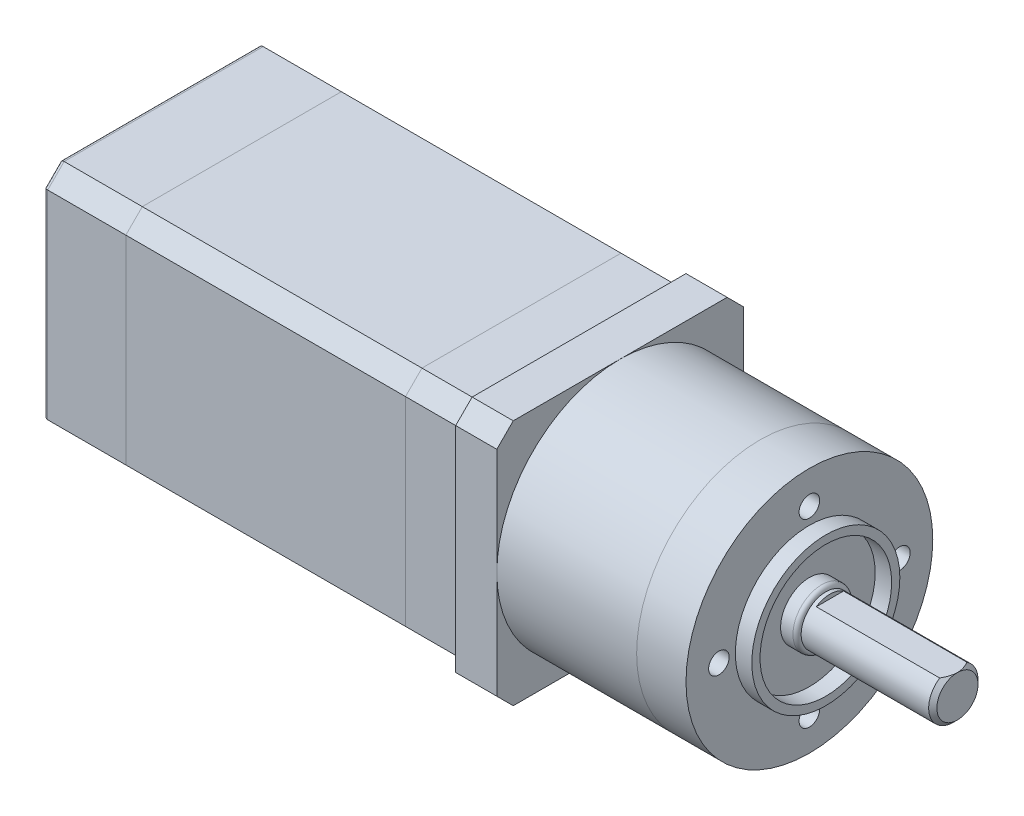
ISO-10303-21;
HEADER;
FILE_DESCRIPTION(('STEP AP214'),'2;1');
FILE_NAME('part.step','',(''),(''),'','','');
FILE_SCHEMA(('AUTOMOTIVE_DESIGN { 1 0 10303 214 1 1 1 1 }'));
ENDSEC;
DATA;
#1=APPLICATION_CONTEXT('core data for automotive mechanical design processes');
#2=APPLICATION_PROTOCOL_DEFINITION('international standard','automotive_design',2000,#1);
#3=PRODUCT_CONTEXT('',#1,'mechanical');
#4=PRODUCT('Part','Part','',(#3));
#5=PRODUCT_RELATED_PRODUCT_CATEGORY('part','',(#4));
#6=PRODUCT_DEFINITION_FORMATION('','',#4);
#7=PRODUCT_DEFINITION_CONTEXT('part definition',#1,'design');
#8=PRODUCT_DEFINITION('design','',#6,#7);
#9=PRODUCT_DEFINITION_SHAPE('','',#8);
#10=(LENGTH_UNIT() NAMED_UNIT(*) SI_UNIT(.MILLI.,.METRE.));
#11=(NAMED_UNIT(*) PLANE_ANGLE_UNIT() SI_UNIT($,.RADIAN.));
#12=(NAMED_UNIT(*) SI_UNIT($,.STERADIAN.) SOLID_ANGLE_UNIT());
#13=UNCERTAINTY_MEASURE_WITH_UNIT(LENGTH_MEASURE(1.E-05),#10,'distance_accuracy_value','');
#14=(GEOMETRIC_REPRESENTATION_CONTEXT(3) GLOBAL_UNCERTAINTY_ASSIGNED_CONTEXT((#13)) GLOBAL_UNIT_ASSIGNED_CONTEXT((#10,
#11,#12)) REPRESENTATION_CONTEXT('',''));
#15=CARTESIAN_POINT('',(0.,0.,0.));
#16=DIRECTION('',(0.,0.,1.));
#17=DIRECTION('',(1.,0.,0.));
#18=AXIS2_PLACEMENT_3D('',#15,#16,#17);
#19=CARTESIAN_POINT('',(24.,0.,0.));
#20=DIRECTION('',(-1.,0.,0.));
#21=DIRECTION('',(0.,0.,1.));
#22=AXIS2_PLACEMENT_3D('',#19,#20,#21);
#23=CYLINDRICAL_SURFACE('',#22,3.);
#24=DIRECTION('',(1.,0.,0.));
#25=VECTOR('',#24,1.);
#26=CARTESIAN_POINT('',(8.5,2.5,-1.6583123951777));
#27=LINE('',#26,#25);
#28=CARTESIAN_POINT('',(8.5,2.5,-1.6583123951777));
#29=VERTEX_POINT('',#28);
#30=CARTESIAN_POINT('',(23.5,2.5,-1.6583123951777));
#31=VERTEX_POINT('',#30);
#32=EDGE_CURVE('E85',#29,#31,#27,.T.);
#33=ORIENTED_EDGE('',*,*,#32,.T.);
#34=CARTESIAN_POINT('',(23.5,0.,0.));
#35=DIRECTION('',(1.,0.,0.));
#36=DIRECTION('',(0.,0.,-1.));
#37=AXIS2_PLACEMENT_3D('',#34,#35,#36);
#38=CIRCLE('',#37,3.);
#39=CARTESIAN_POINT('',(23.5,2.5,1.6583123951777));
#40=VERTEX_POINT('',#39);
#41=EDGE_CURVE('E12',#31,#40,#38,.F.);
#42=ORIENTED_EDGE('',*,*,#41,.T.);
#43=DIRECTION('',(1.,0.,0.));
#44=VECTOR('',#43,1.);
#45=CARTESIAN_POINT('',(8.5,2.5,1.6583123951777));
#46=LINE('',#45,#44);
#47=CARTESIAN_POINT('',(8.5,2.5,1.6583123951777));
#48=VERTEX_POINT('',#47);
#49=EDGE_CURVE('E83',#48,#40,#46,.T.);
#50=ORIENTED_EDGE('',*,*,#49,.F.);
#51=CARTESIAN_POINT('',(8.5,0.,0.));
#52=DIRECTION('',(1.,0.,0.));
#53=DIRECTION('',(0.,0.,-1.));
#54=AXIS2_PLACEMENT_3D('',#51,#52,#53);
#55=CIRCLE('',#54,3.);
#56=EDGE_CURVE('E77',#29,#48,#55,.T.);
#57=ORIENTED_EDGE('',*,*,#56,.F.);
#58=EDGE_LOOP('',(#33,#42,#50,#57));
#59=FACE_BOUND('',#58,.T.);
#60=CARTESIAN_POINT('',(8.,0.,0.));
#61=DIRECTION('',(1.,0.,0.));
#62=DIRECTION('',(0.,0.,-1.));
#63=AXIS2_PLACEMENT_3D('',#60,#61,#62);
#64=CIRCLE('',#63,3.);
#65=CARTESIAN_POINT('',(8.,0.,-3.));
#66=VERTEX_POINT('',#65);
#67=EDGE_CURVE('E89',#66,#66,#64,.T.);
#68=ORIENTED_EDGE('',*,*,#67,.T.);
#69=EDGE_LOOP('',(#68));
#70=FACE_BOUND('',#69,.T.);
#71=ADVANCED_FACE('F46',(#59,#70),#23,.T.);
#72=CARTESIAN_POINT('',(24.,0.,0.));
#73=DIRECTION('',(1.,0.,0.));
#74=DIRECTION('',(0.,0.,-1.));
#75=AXIS2_PLACEMENT_3D('',#72,#73,#74);
#76=PLANE('',#75);
#77=CARTESIAN_POINT('',(24.,0.,0.));
#78=DIRECTION('',(1.,0.,0.));
#79=DIRECTION('',(0.,0.,-1.));
#80=AXIS2_PLACEMENT_3D('',#77,#78,#79);
#81=CIRCLE('',#80,2.50000000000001);
#82=CARTESIAN_POINT('',(24.,2.5,0.));
#83=VERTEX_POINT('',#82);
#84=EDGE_CURVE('E94',#83,#83,#81,.T.);
#85=ORIENTED_EDGE('',*,*,#84,.T.);
#86=EDGE_LOOP('',(#85));
#87=FACE_BOUND('',#86,.T.);
#88=ADVANCED_FACE('F110',(#87),#76,.T.);
#89=CARTESIAN_POINT('',(8.,0.,0.));
#90=DIRECTION('',(1.,0.,0.));
#91=DIRECTION('',(0.,0.,-1.));
#92=AXIS2_PLACEMENT_3D('',#89,#90,#91);
#93=PLANE('',#92);
#94=ORIENTED_EDGE('',*,*,#67,.F.);
#95=EDGE_LOOP('',(#94));
#96=FACE_BOUND('',#95,.T.);
#97=ADVANCED_FACE('F109',(#96),#93,.F.);
#98=CARTESIAN_POINT('',(8.5,2.5,-1.6583123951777));
#99=DIRECTION('',(0.,-1.,0.));
#100=DIRECTION('',(0.,0.,-1.));
#101=AXIS2_PLACEMENT_3D('',#98,#99,#100);
#102=PLANE('',#101);
#103=CARTESIAN_POINT('',(23.5,2.5,1.6583123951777));
#104=CARTESIAN_POINT('',(23.5250200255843,2.5,1.61304419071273));
#105=CARTESIAN_POINT('',(23.549499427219,2.5,1.56747781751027));
#106=CARTESIAN_POINT('',(23.5972096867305,2.5,1.47571363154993));
#107=CARTESIAN_POINT('',(23.6204409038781,2.5,1.42951600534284));
#108=CARTESIAN_POINT('',(23.6882337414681,2.5,1.28946898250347));
#109=CARTESIAN_POINT('',(23.7306685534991,2.5,1.19456817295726));
#110=CARTESIAN_POINT('',(23.8071641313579,2.5,1.00435832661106));
#111=CARTESIAN_POINT('',(23.8414185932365,2.5,0.909128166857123));
#112=CARTESIAN_POINT('',(23.9011186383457,2.5,0.715960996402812));
#113=CARTESIAN_POINT('',(23.9265705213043,2.5,0.618025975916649));
#114=CARTESIAN_POINT('',(23.96395141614,2.5,0.434096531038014));
#115=CARTESIAN_POINT('',(23.9772928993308,2.5,0.348395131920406));
#116=CARTESIAN_POINT('',(23.9908266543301,2.5,0.218706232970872));
#117=CARTESIAN_POINT('',(23.9942588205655,2.5,0.175042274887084));
#118=CARTESIAN_POINT('',(23.9988484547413,2.5,0.0875881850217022));
#119=CARTESIAN_POINT('',(24.0000055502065,2.5,0.0437980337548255));
#120=CARTESIAN_POINT('',(24.,2.5,0.));
#121=B_SPLINE_CURVE_WITH_KNOTS('',3,(#103,#104,#105,#106,#107,#108,#109,#110,#111,#112,#113,
#114,#115,#116,#117,#118,#119,#120),.UNSPECIFIED.,.F.,.F.,(4,2,2,2,2,2,2,2,4),(0.,
0.155160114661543,0.310275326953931,0.621889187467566,0.925164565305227,1.22822244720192,
1.48798349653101,1.61932602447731,1.75069005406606),.UNSPECIFIED.);
#122=EDGE_CURVE('E97',#40,#83,#121,.T.);
#123=ORIENTED_EDGE('',*,*,#122,.T.);
#124=CARTESIAN_POINT('',(24.,2.50000000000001,0.));
#125=CARTESIAN_POINT('',(24.0000643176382,2.5,-0.0768428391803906));
#126=CARTESIAN_POINT('',(23.9964585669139,2.5,-0.153646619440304));
#127=CARTESIAN_POINT('',(23.9824138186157,2.5,-0.306486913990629));
#128=CARTESIAN_POINT('',(23.9719877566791,2.5,-0.38252460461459));
#129=CARTESIAN_POINT('',(23.9450231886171,2.5,-0.532231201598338));
#130=CARTESIAN_POINT('',(23.9285851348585,2.5,-0.605918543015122));
#131=CARTESIAN_POINT('',(23.8903277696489,2.5,-0.751897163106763));
#132=CARTESIAN_POINT('',(23.8685063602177,2.5,-0.824187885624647));
#133=CARTESIAN_POINT('',(23.8222417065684,2.5,-0.961361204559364));
#134=CARTESIAN_POINT('',(23.7981581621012,2.5,-1.02636662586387));
#135=CARTESIAN_POINT('',(23.7466971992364,2.5,-1.15505562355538));
#136=CARTESIAN_POINT('',(23.7193196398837,2.5,-1.21873914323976));
#137=CARTESIAN_POINT('',(23.6613450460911,2.5,-1.34581351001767));
#138=CARTESIAN_POINT('',(23.6307045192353,2.5,-1.40918435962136));
#139=CARTESIAN_POINT('',(23.567035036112,2.5,-1.53466113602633));
#140=CARTESIAN_POINT('',(23.5340077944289,2.5,-1.59676793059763));
#141=CARTESIAN_POINT('',(23.5,2.5,-1.6583123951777));
#142=B_SPLINE_CURVE_WITH_KNOTS('',3,(#124,#125,#126,#127,#128,#129,#130,#131,#132,#133,#134,
#135,#136,#137,#138,#139,#140,#141),.UNSPECIFIED.,.F.,.F.,(4,2,2,2,2,2,2,2,4),(0.,
0.230381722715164,0.460327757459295,0.68659521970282,0.912951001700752,1.120819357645,
1.32869661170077,1.53981070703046,1.75077462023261),.UNSPECIFIED.);
#143=EDGE_CURVE('E55',#83,#31,#142,.T.);
#144=ORIENTED_EDGE('',*,*,#143,.T.);
#145=ORIENTED_EDGE('',*,*,#32,.F.);
#146=DIRECTION('',(0.,0.,-1.));
#147=VECTOR('',#146,1.);
#148=CARTESIAN_POINT('',(8.5,2.5,-1.6583123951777));
#149=LINE('',#148,#147);
#150=EDGE_CURVE('E80',#48,#29,#149,.T.);
#151=ORIENTED_EDGE('',*,*,#150,.F.);
#152=ORIENTED_EDGE('',*,*,#49,.T.);
#153=EDGE_LOOP('',(#123,#144,#145,#151,#152));
#154=FACE_BOUND('',#153,.T.);
#155=ADVANCED_FACE('F82',(#154),#102,.F.);
#156=CARTESIAN_POINT('',(8.5,0.,0.));
#157=DIRECTION('',(1.,0.,0.));
#158=DIRECTION('',(0.,0.,-1.));
#159=AXIS2_PLACEMENT_3D('',#156,#157,#158);
#160=PLANE('',#159);
#161=ORIENTED_EDGE('',*,*,#56,.T.);
#162=ORIENTED_EDGE('',*,*,#150,.T.);
#163=EDGE_LOOP('',(#161,#162));
#164=FACE_BOUND('',#163,.T.);
#165=ADVANCED_FACE('F79',(#164),#160,.T.);
#166=CARTESIAN_POINT('',(24.,0.,0.));
#167=DIRECTION('',(-1.,0.,0.));
#168=DIRECTION('',(0.,0.,1.));
#169=AXIS2_PLACEMENT_3D('',#166,#167,#168);
#170=CONICAL_SURFACE('',#169,2.50000000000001,0.785398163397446);
#171=ORIENTED_EDGE('',*,*,#122,.F.);
#172=ORIENTED_EDGE('',*,*,#41,.F.);
#173=ORIENTED_EDGE('',*,*,#143,.F.);
#174=ORIENTED_EDGE('',*,*,#84,.F.);
#175=EDGE_LOOP('',(#171,#172,#173,#174));
#176=FACE_BOUND('',#175,.T.);
#177=ADVANCED_FACE('F48',(#176),#170,.T.);
#178=CLOSED_SHELL('',(#71,#88,#97,#155,#165,#177));
#179=MANIFOLD_SOLID_BREP('B2',#178);
#180=CARTESIAN_POINT('',(-73.,12.1,-14.1));
#181=DIRECTION('',(0.,-0.707106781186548,0.707106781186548));
#182=DIRECTION('',(0.,-0.707106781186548,-0.707106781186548));
#183=AXIS2_PLACEMENT_3D('',#180,#181,#182);
#184=PLANE('',#183);
#185=DIRECTION('',(1.,0.,0.));
#186=VECTOR('',#185,1.);
#187=CARTESIAN_POINT('',(-73.,12.1,-14.1));
#188=LINE('',#187,#186);
#189=CARTESIAN_POINT('',(-72.5,12.1,-14.1));
#190=VERTEX_POINT('',#189);
#191=CARTESIAN_POINT('',(-63.,12.1,-14.1));
#192=VERTEX_POINT('',#191);
#193=EDGE_CURVE('E261',#190,#192,#188,.T.);
#194=ORIENTED_EDGE('',*,*,#193,.F.);
#195=DIRECTION('',(0.,-0.707106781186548,-0.707106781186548));
#196=VECTOR('',#195,1.);
#197=CARTESIAN_POINT('',(-72.5,14.1,-12.1));
#198=LINE('',#197,#196);
#199=CARTESIAN_POINT('',(-72.5,14.1,-12.1));
#200=VERTEX_POINT('',#199);
#201=EDGE_CURVE('E44',#190,#200,#198,.F.);
#202=ORIENTED_EDGE('',*,*,#201,.T.);
#203=DIRECTION('',(1.,0.,0.));
#204=VECTOR('',#203,1.);
#205=CARTESIAN_POINT('',(-73.,14.1,-12.1));
#206=LINE('',#205,#204);
#207=CARTESIAN_POINT('',(-63.,14.1,-12.1));
#208=VERTEX_POINT('',#207);
#209=EDGE_CURVE('E282',#200,#208,#206,.T.);
#210=ORIENTED_EDGE('',*,*,#209,.T.);
#211=DIRECTION('',(0.,-0.707106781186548,-0.707106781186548));
#212=VECTOR('',#211,1.);
#213=CARTESIAN_POINT('',(-63.,12.1,-14.1));
#214=LINE('',#213,#212);
#215=EDGE_CURVE('E276',#208,#192,#214,.T.);
#216=ORIENTED_EDGE('',*,*,#215,.T.);
#217=EDGE_LOOP('',(#194,#202,#210,#216));
#218=FACE_BOUND('',#217,.T.);
#219=ADVANCED_FACE('F173',(#218),#184,.F.);
#220=CARTESIAN_POINT('',(-73.,-12.1,-14.1));
#221=DIRECTION('',(0.,0.,1.));
#222=DIRECTION('',(1.,0.,0.));
#223=AXIS2_PLACEMENT_3D('',#220,#221,#222);
#224=PLANE('',#223);
#225=DIRECTION('',(1.,0.,0.));
#226=VECTOR('',#225,1.);
#227=CARTESIAN_POINT('',(-73.,-12.1,-14.1));
#228=LINE('',#227,#226);
#229=CARTESIAN_POINT('',(-72.5,-12.1,-14.1));
#230=VERTEX_POINT('',#229);
#231=CARTESIAN_POINT('',(-63.,-12.1,-14.1));
#232=VERTEX_POINT('',#231);
#233=EDGE_CURVE('E270',#230,#232,#228,.T.);
#234=ORIENTED_EDGE('',*,*,#233,.F.);
#235=DIRECTION('',(0.,-1.,0.));
#236=VECTOR('',#235,1.);
#237=CARTESIAN_POINT('',(-72.5,12.1,-14.1));
#238=LINE('',#237,#236);
#239=EDGE_CURVE('E182',#230,#190,#238,.F.);
#240=ORIENTED_EDGE('',*,*,#239,.T.);
#241=ORIENTED_EDGE('',*,*,#193,.T.);
#242=DIRECTION('',(0.,-1.,0.));
#243=VECTOR('',#242,1.);
#244=CARTESIAN_POINT('',(-63.,-12.1,-14.1));
#245=LINE('',#244,#243);
#246=EDGE_CURVE('E264',#192,#232,#245,.T.);
#247=ORIENTED_EDGE('',*,*,#246,.T.);
#248=EDGE_LOOP('',(#234,#240,#241,#247));
#249=FACE_BOUND('',#248,.T.);
#250=ADVANCED_FACE('F263',(#249),#224,.F.);
#251=CARTESIAN_POINT('',(-73.,-14.1,-12.1));
#252=DIRECTION('',(0.,0.707106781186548,0.707106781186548));
#253=DIRECTION('',(0.,-0.707106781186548,0.707106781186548));
#254=AXIS2_PLACEMENT_3D('',#251,#252,#253);
#255=PLANE('',#254);
#256=DIRECTION('',(1.,0.,0.));
#257=VECTOR('',#256,1.);
#258=CARTESIAN_POINT('',(-73.,-14.1,-12.1));
#259=LINE('',#258,#257);
#260=CARTESIAN_POINT('',(-72.5,-14.1,-12.1));
#261=VERTEX_POINT('',#260);
#262=CARTESIAN_POINT('',(-63.,-14.1,-12.1));
#263=VERTEX_POINT('',#262);
#264=EDGE_CURVE('E312',#261,#263,#259,.T.);
#265=ORIENTED_EDGE('',*,*,#264,.F.);
#266=DIRECTION('',(0.,-0.707106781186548,0.707106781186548));
#267=VECTOR('',#266,1.);
#268=CARTESIAN_POINT('',(-72.5,-12.1,-14.1));
#269=LINE('',#268,#267);
#270=EDGE_CURVE('E197',#261,#230,#269,.F.);
#271=ORIENTED_EDGE('',*,*,#270,.T.);
#272=ORIENTED_EDGE('',*,*,#233,.T.);
#273=DIRECTION('',(0.,-0.707106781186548,0.707106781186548));
#274=VECTOR('',#273,1.);
#275=CARTESIAN_POINT('',(-63.,-14.1,-12.1));
#276=LINE('',#275,#274);
#277=EDGE_CURVE('E279',#232,#263,#276,.T.);
#278=ORIENTED_EDGE('',*,*,#277,.T.);
#279=EDGE_LOOP('',(#265,#271,#272,#278));
#280=FACE_BOUND('',#279,.T.);
#281=ADVANCED_FACE('F415',(#280),#255,.F.);
#282=CARTESIAN_POINT('',(-73.,-14.1,-12.1));
#283=DIRECTION('',(0.,1.,0.));
#284=DIRECTION('',(0.,0.,1.));
#285=AXIS2_PLACEMENT_3D('',#282,#283,#284);
#286=PLANE('',#285);
#287=DIRECTION('',(1.,0.,0.));
#288=VECTOR('',#287,1.);
#289=CARTESIAN_POINT('',(-73.,-14.1,12.1));
#290=LINE('',#289,#288);
#291=CARTESIAN_POINT('',(-72.5,-14.1,12.1));
#292=VERTEX_POINT('',#291);
#293=CARTESIAN_POINT('',(-63.,-14.1,12.1));
#294=VERTEX_POINT('',#293);
#295=EDGE_CURVE('E310',#292,#294,#290,.T.);
#296=ORIENTED_EDGE('',*,*,#295,.F.);
#297=DIRECTION('',(0.,0.,1.));
#298=VECTOR('',#297,1.);
#299=CARTESIAN_POINT('',(-72.5,-14.1,-12.1));
#300=LINE('',#299,#298);
#301=EDGE_CURVE('E340',#292,#261,#300,.F.);
#302=ORIENTED_EDGE('',*,*,#301,.T.);
#303=ORIENTED_EDGE('',*,*,#264,.T.);
#304=DIRECTION('',(0.,0.,1.));
#305=VECTOR('',#304,1.);
#306=CARTESIAN_POINT('',(-63.,-14.1,-12.1));
#307=LINE('',#306,#305);
#308=EDGE_CURVE('E289',#263,#294,#307,.T.);
#309=ORIENTED_EDGE('',*,*,#308,.T.);
#310=EDGE_LOOP('',(#296,#302,#303,#309));
#311=FACE_BOUND('',#310,.T.);
#312=ADVANCED_FACE('F413',(#311),#286,.F.);
#313=CARTESIAN_POINT('',(-73.,-14.1,12.1));
#314=DIRECTION('',(0.,0.707106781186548,-0.707106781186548));
#315=DIRECTION('',(0.,0.707106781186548,0.707106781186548));
#316=AXIS2_PLACEMENT_3D('',#313,#314,#315);
#317=PLANE('',#316);
#318=DIRECTION('',(1.,0.,0.));
#319=VECTOR('',#318,1.);
#320=CARTESIAN_POINT('',(-73.,-12.1,14.1));
#321=LINE('',#320,#319);
#322=CARTESIAN_POINT('',(-72.5,-12.1,14.1));
#323=VERTEX_POINT('',#322);
#324=CARTESIAN_POINT('',(-63.,-12.1,14.1));
#325=VERTEX_POINT('',#324);
#326=EDGE_CURVE('E308',#323,#325,#321,.T.);
#327=ORIENTED_EDGE('',*,*,#326,.F.);
#328=DIRECTION('',(0.,0.707106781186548,0.707106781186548));
#329=VECTOR('',#328,1.);
#330=CARTESIAN_POINT('',(-72.5,-14.1,12.1));
#331=LINE('',#330,#329);
#332=EDGE_CURVE('E338',#323,#292,#331,.F.);
#333=ORIENTED_EDGE('',*,*,#332,.T.);
#334=ORIENTED_EDGE('',*,*,#295,.T.);
#335=DIRECTION('',(0.,0.707106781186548,0.707106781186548));
#336=VECTOR('',#335,1.);
#337=CARTESIAN_POINT('',(-63.,-14.1,12.1));
#338=LINE('',#337,#336);
#339=EDGE_CURVE('E292',#294,#325,#338,.T.);
#340=ORIENTED_EDGE('',*,*,#339,.T.);
#341=EDGE_LOOP('',(#327,#333,#334,#340));
#342=FACE_BOUND('',#341,.T.);
#343=ADVANCED_FACE('F411',(#342),#317,.F.);
#344=CARTESIAN_POINT('',(-73.,-12.1,14.1));
#345=DIRECTION('',(0.,0.,-1.));
#346=DIRECTION('',(0.,1.,0.));
#347=AXIS2_PLACEMENT_3D('',#344,#345,#346);
#348=PLANE('',#347);
#349=DIRECTION('',(1.,0.,0.));
#350=VECTOR('',#349,1.);
#351=CARTESIAN_POINT('',(-73.,12.1,14.1));
#352=LINE('',#351,#350);
#353=CARTESIAN_POINT('',(-72.5,12.1,14.1));
#354=VERTEX_POINT('',#353);
#355=CARTESIAN_POINT('',(-63.,12.1,14.1));
#356=VERTEX_POINT('',#355);
#357=EDGE_CURVE('E306',#354,#356,#352,.T.);
#358=ORIENTED_EDGE('',*,*,#357,.F.);
#359=DIRECTION('',(0.,1.,0.));
#360=VECTOR('',#359,1.);
#361=CARTESIAN_POINT('',(-72.5,-12.1,14.1));
#362=LINE('',#361,#360);
#363=EDGE_CURVE('E336',#354,#323,#362,.F.);
#364=ORIENTED_EDGE('',*,*,#363,.T.);
#365=ORIENTED_EDGE('',*,*,#326,.T.);
#366=DIRECTION('',(0.,1.,0.));
#367=VECTOR('',#366,1.);
#368=CARTESIAN_POINT('',(-63.,-12.1,14.1));
#369=LINE('',#368,#367);
#370=EDGE_CURVE('E295',#325,#356,#369,.T.);
#371=ORIENTED_EDGE('',*,*,#370,.T.);
#372=EDGE_LOOP('',(#358,#364,#365,#371));
#373=FACE_BOUND('',#372,.T.);
#374=ADVANCED_FACE('F399',(#373),#348,.F.);
#375=CARTESIAN_POINT('',(-73.,12.1,14.1));
#376=DIRECTION('',(0.,-0.707106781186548,-0.707106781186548));
#377=DIRECTION('',(0.,0.707106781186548,-0.707106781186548));
#378=AXIS2_PLACEMENT_3D('',#375,#376,#377);
#379=PLANE('',#378);
#380=DIRECTION('',(1.,0.,0.));
#381=VECTOR('',#380,1.);
#382=CARTESIAN_POINT('',(-73.,14.1,12.1));
#383=LINE('',#382,#381);
#384=CARTESIAN_POINT('',(-72.5,14.1,12.1));
#385=VERTEX_POINT('',#384);
#386=CARTESIAN_POINT('',(-63.,14.1,12.1));
#387=VERTEX_POINT('',#386);
#388=EDGE_CURVE('E304',#385,#387,#383,.T.);
#389=ORIENTED_EDGE('',*,*,#388,.F.);
#390=DIRECTION('',(0.,0.707106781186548,-0.707106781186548));
#391=VECTOR('',#390,1.);
#392=CARTESIAN_POINT('',(-72.5,12.1,14.1));
#393=LINE('',#392,#391);
#394=EDGE_CURVE('E334',#385,#354,#393,.F.);
#395=ORIENTED_EDGE('',*,*,#394,.T.);
#396=ORIENTED_EDGE('',*,*,#357,.T.);
#397=DIRECTION('',(0.,0.707106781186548,-0.707106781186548));
#398=VECTOR('',#397,1.);
#399=CARTESIAN_POINT('',(-63.,12.1,14.1));
#400=LINE('',#399,#398);
#401=EDGE_CURVE('E298',#356,#387,#400,.T.);
#402=ORIENTED_EDGE('',*,*,#401,.T.);
#403=EDGE_LOOP('',(#389,#395,#396,#402));
#404=FACE_BOUND('',#403,.T.);
#405=ADVANCED_FACE('F396',(#404),#379,.F.);
#406=CARTESIAN_POINT('',(-73.,14.1,-12.1));
#407=DIRECTION('',(0.,-1.,0.));
#408=DIRECTION('',(0.,0.,-1.));
#409=AXIS2_PLACEMENT_3D('',#406,#407,#408);
#410=PLANE('',#409);
#411=ORIENTED_EDGE('',*,*,#209,.F.);
#412=DIRECTION('',(0.,0.,-1.));
#413=VECTOR('',#412,1.);
#414=CARTESIAN_POINT('',(-72.5,14.1,12.1));
#415=LINE('',#414,#413);
#416=EDGE_CURVE('E331',#200,#385,#415,.F.);
#417=ORIENTED_EDGE('',*,*,#416,.T.);
#418=ORIENTED_EDGE('',*,*,#388,.T.);
#419=DIRECTION('',(0.,0.,-1.));
#420=VECTOR('',#419,1.);
#421=CARTESIAN_POINT('',(-63.,14.1,-12.1));
#422=LINE('',#421,#420);
#423=EDGE_CURVE('E301',#387,#208,#422,.T.);
#424=ORIENTED_EDGE('',*,*,#423,.T.);
#425=EDGE_LOOP('',(#411,#417,#418,#424));
#426=FACE_BOUND('',#425,.T.);
#427=ADVANCED_FACE('F383',(#426),#410,.F.);
#428=CARTESIAN_POINT('',(-73.,0.,0.));
#429=DIRECTION('',(-1.,0.,0.));
#430=DIRECTION('',(0.,0.,1.));
#431=AXIS2_PLACEMENT_3D('',#428,#429,#430);
#432=PLANE('',#431);
#433=DIRECTION('',(0.,0.707106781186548,-0.707106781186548));
#434=VECTOR('',#433,1.);
#435=CARTESIAN_POINT('',(-73.,13.7464466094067,11.7464466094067));
#436=LINE('',#435,#434);
#437=CARTESIAN_POINT('',(-73.,11.8928932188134,13.6));
#438=VERTEX_POINT('',#437);
#439=CARTESIAN_POINT('',(-73.,13.6,11.8928932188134));
#440=VERTEX_POINT('',#439);
#441=EDGE_CURVE('E326',#438,#440,#436,.T.);
#442=ORIENTED_EDGE('',*,*,#441,.T.);
#443=DIRECTION('',(0.,0.,-1.));
#444=VECTOR('',#443,1.);
#445=CARTESIAN_POINT('',(-73.,13.6,-12.1));
#446=LINE('',#445,#444);
#447=CARTESIAN_POINT('',(-73.,13.6,-11.8928932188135));
#448=VERTEX_POINT('',#447);
#449=EDGE_CURVE('E328',#440,#448,#446,.T.);
#450=ORIENTED_EDGE('',*,*,#449,.T.);
#451=DIRECTION('',(0.,-0.707106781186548,-0.707106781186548));
#452=VECTOR('',#451,1.);
#453=CARTESIAN_POINT('',(-73.,11.7464466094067,-13.7464466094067));
#454=LINE('',#453,#452);
#455=CARTESIAN_POINT('',(-73.,11.8928932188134,-13.6));
#456=VERTEX_POINT('',#455);
#457=EDGE_CURVE('E269',#448,#456,#454,.T.);
#458=ORIENTED_EDGE('',*,*,#457,.T.);
#459=DIRECTION('',(0.,-1.,0.));
#460=VECTOR('',#459,1.);
#461=CARTESIAN_POINT('',(-73.,-12.1,-13.6));
#462=LINE('',#461,#460);
#463=CARTESIAN_POINT('',(-73.,-11.8928932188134,-13.6));
#464=VERTEX_POINT('',#463);
#465=EDGE_CURVE('E316',#456,#464,#462,.T.);
#466=ORIENTED_EDGE('',*,*,#465,.T.);
#467=DIRECTION('',(0.,-0.707106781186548,0.707106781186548));
#468=VECTOR('',#467,1.);
#469=CARTESIAN_POINT('',(-73.,-13.7464466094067,-11.7464466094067));
#470=LINE('',#469,#468);
#471=CARTESIAN_POINT('',(-73.,-13.6,-11.8928932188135));
#472=VERTEX_POINT('',#471);
#473=EDGE_CURVE('E318',#464,#472,#470,.T.);
#474=ORIENTED_EDGE('',*,*,#473,.T.);
#475=DIRECTION('',(0.,0.,1.));
#476=VECTOR('',#475,1.);
#477=CARTESIAN_POINT('',(-73.,-13.6,12.1));
#478=LINE('',#477,#476);
#479=CARTESIAN_POINT('',(-73.,-13.6,11.8928932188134));
#480=VERTEX_POINT('',#479);
#481=EDGE_CURVE('E320',#472,#480,#478,.T.);
#482=ORIENTED_EDGE('',*,*,#481,.T.);
#483=DIRECTION('',(0.,0.707106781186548,0.707106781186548));
#484=VECTOR('',#483,1.);
#485=CARTESIAN_POINT('',(-73.,-11.7464466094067,13.7464466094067));
#486=LINE('',#485,#484);
#487=CARTESIAN_POINT('',(-73.,-11.8928932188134,13.6));
#488=VERTEX_POINT('',#487);
#489=EDGE_CURVE('E322',#480,#488,#486,.T.);
#490=ORIENTED_EDGE('',*,*,#489,.T.);
#491=DIRECTION('',(0.,1.,0.));
#492=VECTOR('',#491,1.);
#493=CARTESIAN_POINT('',(-73.,12.1,13.6));
#494=LINE('',#493,#492);
#495=EDGE_CURVE('E324',#488,#438,#494,.T.);
#496=ORIENTED_EDGE('',*,*,#495,.T.);
#497=EDGE_LOOP('',(#442,#450,#458,#466,#474,#482,#490,#496));
#498=FACE_BOUND('',#497,.T.);
#499=ADVANCED_FACE('F371',(#498),#432,.T.);
#500=CARTESIAN_POINT('',(-63.,0.,0.));
#501=DIRECTION('',(-1.,0.,0.));
#502=DIRECTION('',(0.,0.,1.));
#503=AXIS2_PLACEMENT_3D('',#500,#501,#502);
#504=PLANE('',#503);
#505=ORIENTED_EDGE('',*,*,#215,.F.);
#506=ORIENTED_EDGE('',*,*,#423,.F.);
#507=ORIENTED_EDGE('',*,*,#401,.F.);
#508=ORIENTED_EDGE('',*,*,#370,.F.);
#509=ORIENTED_EDGE('',*,*,#339,.F.);
#510=ORIENTED_EDGE('',*,*,#308,.F.);
#511=ORIENTED_EDGE('',*,*,#277,.F.);
#512=ORIENTED_EDGE('',*,*,#246,.F.);
#513=EDGE_LOOP('',(#505,#506,#507,#508,#509,#510,#511,#512));
#514=FACE_BOUND('',#513,.T.);
#515=ADVANCED_FACE('F274',(#514),#504,.F.);
#516=CARTESIAN_POINT('',(-72.5,-13.6,0.));
#517=DIRECTION('',(0.,0.,-1.));
#518=DIRECTION('',(-1.,0.,0.));
#519=AXIS2_PLACEMENT_3D('',#516,#517,#518);
#520=CYLINDRICAL_SURFACE('',#519,0.5);
#521=CARTESIAN_POINT('',(-72.5,-13.6,-11.8928932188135));
#522=DIRECTION('',(0.,0.38268343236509,-0.923879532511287));
#523=DIRECTION('',(0.,0.923879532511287,0.38268343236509));
#524=AXIS2_PLACEMENT_3D('',#521,#522,#523);
#525=ELLIPSE('',#524,0.541196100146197,0.5);
#526=EDGE_CURVE('E286',#261,#472,#525,.T.);
#527=ORIENTED_EDGE('',*,*,#526,.F.);
#528=ORIENTED_EDGE('',*,*,#301,.F.);
#529=CARTESIAN_POINT('',(-72.5,-13.6,11.8928932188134));
#530=DIRECTION('',(0.,-0.38268343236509,-0.923879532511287));
#531=DIRECTION('',(0.,0.923879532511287,-0.38268343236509));
#532=AXIS2_PLACEMENT_3D('',#529,#530,#531);
#533=ELLIPSE('',#532,0.541196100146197,0.5);
#534=EDGE_CURVE('E177',#480,#292,#533,.F.);
#535=ORIENTED_EDGE('',*,*,#534,.F.);
#536=ORIENTED_EDGE('',*,*,#481,.F.);
#537=EDGE_LOOP('',(#527,#528,#535,#536));
#538=FACE_BOUND('',#537,.T.);
#539=ADVANCED_FACE('F175',(#538),#520,.T.);
#540=CARTESIAN_POINT('',(-72.5,-12.7464466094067,12.7464466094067));
#541=DIRECTION('',(0.,-0.707106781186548,-0.707106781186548));
#542=DIRECTION('',(0.,0.707106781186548,-0.707106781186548));
#543=AXIS2_PLACEMENT_3D('',#540,#541,#542);
#544=CYLINDRICAL_SURFACE('',#543,0.5);
#545=ORIENTED_EDGE('',*,*,#534,.T.);
#546=ORIENTED_EDGE('',*,*,#332,.F.);
#547=CARTESIAN_POINT('',(-72.5,-11.8928932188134,13.6));
#548=DIRECTION('',(0.,-0.923879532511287,-0.38268343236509));
#549=DIRECTION('',(0.,0.38268343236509,-0.923879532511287));
#550=AXIS2_PLACEMENT_3D('',#547,#548,#549);
#551=ELLIPSE('',#550,0.541196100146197,0.5);
#552=EDGE_CURVE('E357',#488,#323,#551,.F.);
#553=ORIENTED_EDGE('',*,*,#552,.F.);
#554=ORIENTED_EDGE('',*,*,#489,.F.);
#555=EDGE_LOOP('',(#545,#546,#553,#554));
#556=FACE_BOUND('',#555,.T.);
#557=ADVANCED_FACE('F408',(#556),#544,.T.);
#558=CARTESIAN_POINT('',(-72.5,-12.7464466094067,-12.7464466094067));
#559=DIRECTION('',(0.,0.707106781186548,-0.707106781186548));
#560=DIRECTION('',(0.,0.707106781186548,0.707106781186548));
#561=AXIS2_PLACEMENT_3D('',#558,#559,#560);
#562=CYLINDRICAL_SURFACE('',#561,0.5);
#563=ORIENTED_EDGE('',*,*,#526,.T.);
#564=ORIENTED_EDGE('',*,*,#473,.F.);
#565=CARTESIAN_POINT('',(-72.5,-11.8928932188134,-13.6));
#566=DIRECTION('',(0.,0.923879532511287,-0.38268343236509));
#567=DIRECTION('',(0.,0.38268343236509,0.923879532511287));
#568=AXIS2_PLACEMENT_3D('',#565,#566,#567);
#569=ELLIPSE('',#568,0.541196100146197,0.5);
#570=EDGE_CURVE('E354',#230,#464,#569,.T.);
#571=ORIENTED_EDGE('',*,*,#570,.F.);
#572=ORIENTED_EDGE('',*,*,#270,.F.);
#573=EDGE_LOOP('',(#563,#564,#571,#572));
#574=FACE_BOUND('',#573,.T.);
#575=ADVANCED_FACE('F363',(#574),#562,.T.);
#576=CARTESIAN_POINT('',(-72.5,0.,13.6));
#577=DIRECTION('',(0.,-1.,0.));
#578=DIRECTION('',(0.,0.,-1.));
#579=AXIS2_PLACEMENT_3D('',#576,#577,#578);
#580=CYLINDRICAL_SURFACE('',#579,0.5);
#581=ORIENTED_EDGE('',*,*,#552,.T.);
#582=ORIENTED_EDGE('',*,*,#363,.F.);
#583=CARTESIAN_POINT('',(-72.5,11.8928932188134,13.6));
#584=DIRECTION('',(0.,-0.923879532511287,0.38268343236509));
#585=DIRECTION('',(0.,-0.38268343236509,-0.923879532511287));
#586=AXIS2_PLACEMENT_3D('',#583,#584,#585);
#587=ELLIPSE('',#586,0.541196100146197,0.5);
#588=EDGE_CURVE('E351',#438,#354,#587,.F.);
#589=ORIENTED_EDGE('',*,*,#588,.F.);
#590=ORIENTED_EDGE('',*,*,#495,.F.);
#591=EDGE_LOOP('',(#581,#582,#589,#590));
#592=FACE_BOUND('',#591,.T.);
#593=ADVANCED_FACE('F404',(#592),#580,.T.);
#594=CARTESIAN_POINT('',(-72.5,0.,-13.6));
#595=DIRECTION('',(0.,1.,0.));
#596=DIRECTION('',(0.,0.,1.));
#597=AXIS2_PLACEMENT_3D('',#594,#595,#596);
#598=CYLINDRICAL_SURFACE('',#597,0.5);
#599=ORIENTED_EDGE('',*,*,#570,.T.);
#600=ORIENTED_EDGE('',*,*,#465,.F.);
#601=CARTESIAN_POINT('',(-72.5,11.8928932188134,-13.6));
#602=DIRECTION('',(0.,0.923879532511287,0.38268343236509));
#603=DIRECTION('',(0.,-0.38268343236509,0.923879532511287));
#604=AXIS2_PLACEMENT_3D('',#601,#602,#603);
#605=ELLIPSE('',#604,0.541196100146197,0.5);
#606=EDGE_CURVE('E348',#190,#456,#605,.T.);
#607=ORIENTED_EDGE('',*,*,#606,.F.);
#608=ORIENTED_EDGE('',*,*,#239,.F.);
#609=EDGE_LOOP('',(#599,#600,#607,#608));
#610=FACE_BOUND('',#609,.T.);
#611=ADVANCED_FACE('F376',(#610),#598,.T.);
#612=CARTESIAN_POINT('',(-72.5,12.7464466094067,12.7464466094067));
#613=DIRECTION('',(0.,-0.707106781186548,0.707106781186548));
#614=DIRECTION('',(0.,-0.707106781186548,-0.707106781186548));
#615=AXIS2_PLACEMENT_3D('',#612,#613,#614);
#616=CYLINDRICAL_SURFACE('',#615,0.5);
#617=ORIENTED_EDGE('',*,*,#588,.T.);
#618=ORIENTED_EDGE('',*,*,#394,.F.);
#619=CARTESIAN_POINT('',(-72.5,13.6,11.8928932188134));
#620=DIRECTION('',(0.,-0.38268343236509,0.923879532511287));
#621=DIRECTION('',(0.,-0.923879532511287,-0.38268343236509));
#622=AXIS2_PLACEMENT_3D('',#619,#620,#621);
#623=ELLIPSE('',#622,0.541196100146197,0.5);
#624=EDGE_CURVE('E346',#440,#385,#623,.F.);
#625=ORIENTED_EDGE('',*,*,#624,.F.);
#626=ORIENTED_EDGE('',*,*,#441,.F.);
#627=EDGE_LOOP('',(#617,#618,#625,#626));
#628=FACE_BOUND('',#627,.T.);
#629=ADVANCED_FACE('F392',(#628),#616,.T.);
#630=CARTESIAN_POINT('',(-72.5,12.7464466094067,-12.7464466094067));
#631=DIRECTION('',(0.,0.707106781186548,0.707106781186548));
#632=DIRECTION('',(0.,-0.707106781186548,0.707106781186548));
#633=AXIS2_PLACEMENT_3D('',#630,#631,#632);
#634=CYLINDRICAL_SURFACE('',#633,0.5);
#635=ORIENTED_EDGE('',*,*,#606,.T.);
#636=ORIENTED_EDGE('',*,*,#457,.F.);
#637=CARTESIAN_POINT('',(-72.5,13.6,-11.8928932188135));
#638=DIRECTION('',(0.,0.38268343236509,0.923879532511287));
#639=DIRECTION('',(0.,0.923879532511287,-0.38268343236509));
#640=AXIS2_PLACEMENT_3D('',#637,#638,#639);
#641=ELLIPSE('',#640,0.541196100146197,0.5);
#642=EDGE_CURVE('E344',#200,#448,#641,.T.);
#643=ORIENTED_EDGE('',*,*,#642,.F.);
#644=ORIENTED_EDGE('',*,*,#201,.F.);
#645=EDGE_LOOP('',(#635,#636,#643,#644));
#646=FACE_BOUND('',#645,.T.);
#647=ADVANCED_FACE('F379',(#646),#634,.T.);
#648=CARTESIAN_POINT('',(-72.5,13.6,0.));
#649=DIRECTION('',(0.,0.,1.));
#650=DIRECTION('',(0.,-1.,0.));
#651=AXIS2_PLACEMENT_3D('',#648,#649,#650);
#652=CYLINDRICAL_SURFACE('',#651,0.5);
#653=ORIENTED_EDGE('',*,*,#624,.T.);
#654=ORIENTED_EDGE('',*,*,#416,.F.);
#655=ORIENTED_EDGE('',*,*,#642,.T.);
#656=ORIENTED_EDGE('',*,*,#449,.F.);
#657=EDGE_LOOP('',(#653,#654,#655,#656));
#658=FACE_BOUND('',#657,.T.);
#659=ADVANCED_FACE('F386',(#658),#652,.T.);
#660=CLOSED_SHELL('',(#219,#250,#281,#312,#343,#374,#405,#427,#499,#515,#539,#557,#575,#593,
#611,#629,#647,#659));
#661=MANIFOLD_SOLID_BREP('B6',#660);
#662=CARTESIAN_POINT('',(-63.,12.1,-14.1));
#663=DIRECTION('',(0.,-0.707106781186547,0.707106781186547));
#664=DIRECTION('',(0.,-0.707106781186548,-0.707106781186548));
#665=AXIS2_PLACEMENT_3D('',#662,#663,#664);
#666=PLANE('',#665);
#667=DIRECTION('',(0.,-0.707106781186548,-0.707106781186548));
#668=VECTOR('',#667,1.);
#669=CARTESIAN_POINT('',(-29.,12.1,-14.1));
#670=LINE('',#669,#668);
#671=CARTESIAN_POINT('',(-29.,14.1,-12.1));
#672=VERTEX_POINT('',#671);
#673=CARTESIAN_POINT('',(-29.,12.1,-14.1));
#674=VERTEX_POINT('',#673);
#675=EDGE_CURVE('E667',#672,#674,#670,.T.);
#676=ORIENTED_EDGE('',*,*,#675,.T.);
#677=DIRECTION('',(1.,0.,0.));
#678=VECTOR('',#677,1.);
#679=CARTESIAN_POINT('',(-63.,12.1,-14.1));
#680=LINE('',#679,#678);
#681=CARTESIAN_POINT('',(-63.,12.1,-14.1));
#682=VERTEX_POINT('',#681);
#683=EDGE_CURVE('E171',#682,#674,#680,.T.);
#684=ORIENTED_EDGE('',*,*,#683,.F.);
#685=DIRECTION('',(0.,-0.707106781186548,-0.707106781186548));
#686=VECTOR('',#685,1.);
#687=CARTESIAN_POINT('',(-63.,12.1,-14.1));
#688=LINE('',#687,#686);
#689=CARTESIAN_POINT('',(-63.,14.1,-12.1));
#690=VERTEX_POINT('',#689);
#691=EDGE_CURVE('E681',#690,#682,#688,.T.);
#692=ORIENTED_EDGE('',*,*,#691,.F.);
#693=DIRECTION('',(1.,0.,0.));
#694=VECTOR('',#693,1.);
#695=CARTESIAN_POINT('',(-63.,14.1,-12.1));
#696=LINE('',#695,#694);
#697=EDGE_CURVE('E663',#690,#672,#696,.T.);
#698=ORIENTED_EDGE('',*,*,#697,.T.);
#699=EDGE_LOOP('',(#676,#684,#692,#698));
#700=FACE_BOUND('',#699,.T.);
#701=ADVANCED_FACE('F571',(#700),#666,.F.);
#702=CARTESIAN_POINT('',(-63.,-12.1,-14.1));
#703=DIRECTION('',(0.,0.,1.));
#704=DIRECTION('',(1.,0.,0.));
#705=AXIS2_PLACEMENT_3D('',#702,#703,#704);
#706=PLANE('',#705);
#707=DIRECTION('',(0.,-1.,0.));
#708=VECTOR('',#707,1.);
#709=CARTESIAN_POINT('',(-29.,-12.1,-14.1));
#710=LINE('',#709,#708);
#711=CARTESIAN_POINT('',(-29.,-12.1,-14.1));
#712=VERTEX_POINT('',#711);
#713=EDGE_CURVE('E670',#674,#712,#710,.T.);
#714=ORIENTED_EDGE('',*,*,#713,.T.);
#715=DIRECTION('',(1.,0.,0.));
#716=VECTOR('',#715,1.);
#717=CARTESIAN_POINT('',(-63.,-12.1,-14.1));
#718=LINE('',#717,#716);
#719=CARTESIAN_POINT('',(-63.,-12.1,-14.1));
#720=VERTEX_POINT('',#719);
#721=EDGE_CURVE('E579',#720,#712,#718,.T.);
#722=ORIENTED_EDGE('',*,*,#721,.F.);
#723=DIRECTION('',(0.,-1.,0.));
#724=VECTOR('',#723,1.);
#725=CARTESIAN_POINT('',(-63.,-12.1,-14.1));
#726=LINE('',#725,#724);
#727=EDGE_CURVE('E630',#682,#720,#726,.T.);
#728=ORIENTED_EDGE('',*,*,#727,.F.);
#729=ORIENTED_EDGE('',*,*,#683,.T.);
#730=EDGE_LOOP('',(#714,#722,#728,#729));
#731=FACE_BOUND('',#730,.T.);
#732=ADVANCED_FACE('F716',(#731),#706,.F.);
#733=CARTESIAN_POINT('',(-63.,-12.1,-14.1));
#734=DIRECTION('',(0.,0.707106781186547,0.707106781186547));
#735=DIRECTION('',(0.,-0.707106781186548,0.707106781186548));
#736=AXIS2_PLACEMENT_3D('',#733,#734,#735);
#737=PLANE('',#736);
#738=DIRECTION('',(0.,-0.707106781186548,0.707106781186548));
#739=VECTOR('',#738,1.);
#740=CARTESIAN_POINT('',(-29.,-12.1,-14.1));
#741=LINE('',#740,#739);
#742=CARTESIAN_POINT('',(-29.,-14.1,-12.1));
#743=VERTEX_POINT('',#742);
#744=EDGE_CURVE('E672',#712,#743,#741,.T.);
#745=ORIENTED_EDGE('',*,*,#744,.T.);
#746=DIRECTION('',(1.,0.,0.));
#747=VECTOR('',#746,1.);
#748=CARTESIAN_POINT('',(-63.,-14.1,-12.1));
#749=LINE('',#748,#747);
#750=CARTESIAN_POINT('',(-63.,-14.1,-12.1));
#751=VERTEX_POINT('',#750);
#752=EDGE_CURVE('E688',#751,#743,#749,.T.);
#753=ORIENTED_EDGE('',*,*,#752,.F.);
#754=DIRECTION('',(0.,-0.707106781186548,0.707106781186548));
#755=VECTOR('',#754,1.);
#756=CARTESIAN_POINT('',(-63.,-12.1,-14.1));
#757=LINE('',#756,#755);
#758=EDGE_CURVE('E696',#720,#751,#757,.T.);
#759=ORIENTED_EDGE('',*,*,#758,.F.);
#760=ORIENTED_EDGE('',*,*,#721,.T.);
#761=EDGE_LOOP('',(#745,#753,#759,#760));
#762=FACE_BOUND('',#761,.T.);
#763=ADVANCED_FACE('F694',(#762),#737,.F.);
#764=CARTESIAN_POINT('',(-63.,-14.1,-12.1));
#765=DIRECTION('',(0.,1.,0.));
#766=DIRECTION('',(0.,0.,1.));
#767=AXIS2_PLACEMENT_3D('',#764,#765,#766);
#768=PLANE('',#767);
#769=DIRECTION('',(0.,0.,1.));
#770=VECTOR('',#769,1.);
#771=CARTESIAN_POINT('',(-29.,-14.1,-12.1));
#772=LINE('',#771,#770);
#773=CARTESIAN_POINT('',(-29.,-14.1,12.1));
#774=VERTEX_POINT('',#773);
#775=EDGE_CURVE('E674',#743,#774,#772,.T.);
#776=ORIENTED_EDGE('',*,*,#775,.T.);
#777=DIRECTION('',(1.,0.,0.));
#778=VECTOR('',#777,1.);
#779=CARTESIAN_POINT('',(-63.,-14.1,12.1));
#780=LINE('',#779,#778);
#781=CARTESIAN_POINT('',(-63.,-14.1,12.1));
#782=VERTEX_POINT('',#781);
#783=EDGE_CURVE('E685',#782,#774,#780,.T.);
#784=ORIENTED_EDGE('',*,*,#783,.F.);
#785=DIRECTION('',(0.,0.,1.));
#786=VECTOR('',#785,1.);
#787=CARTESIAN_POINT('',(-63.,-14.1,-12.1));
#788=LINE('',#787,#786);
#789=EDGE_CURVE('E708',#751,#782,#788,.T.);
#790=ORIENTED_EDGE('',*,*,#789,.F.);
#791=ORIENTED_EDGE('',*,*,#752,.T.);
#792=EDGE_LOOP('',(#776,#784,#790,#791));
#793=FACE_BOUND('',#792,.T.);
#794=ADVANCED_FACE('F704',(#793),#768,.F.);
#795=CARTESIAN_POINT('',(-63.,-14.1,12.1));
#796=DIRECTION('',(0.,0.707106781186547,-0.707106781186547));
#797=DIRECTION('',(0.,0.707106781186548,0.707106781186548));
#798=AXIS2_PLACEMENT_3D('',#795,#796,#797);
#799=PLANE('',#798);
#800=DIRECTION('',(0.,0.707106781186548,0.707106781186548));
#801=VECTOR('',#800,1.);
#802=CARTESIAN_POINT('',(-29.,-14.1,12.1));
#803=LINE('',#802,#801);
#804=CARTESIAN_POINT('',(-29.,-12.1,14.1));
#805=VERTEX_POINT('',#804);
#806=EDGE_CURVE('E676',#774,#805,#803,.T.);
#807=ORIENTED_EDGE('',*,*,#806,.T.);
#808=DIRECTION('',(1.,0.,0.));
#809=VECTOR('',#808,1.);
#810=CARTESIAN_POINT('',(-63.,-12.1,14.1));
#811=LINE('',#810,#809);
#812=CARTESIAN_POINT('',(-63.,-12.1,14.1));
#813=VERTEX_POINT('',#812);
#814=EDGE_CURVE('E658',#813,#805,#811,.T.);
#815=ORIENTED_EDGE('',*,*,#814,.F.);
#816=DIRECTION('',(0.,0.707106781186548,0.707106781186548));
#817=VECTOR('',#816,1.);
#818=CARTESIAN_POINT('',(-63.,-14.1,12.1));
#819=LINE('',#818,#817);
#820=EDGE_CURVE('E649',#782,#813,#819,.T.);
#821=ORIENTED_EDGE('',*,*,#820,.F.);
#822=ORIENTED_EDGE('',*,*,#783,.T.);
#823=EDGE_LOOP('',(#807,#815,#821,#822));
#824=FACE_BOUND('',#823,.T.);
#825=ADVANCED_FACE('F707',(#824),#799,.F.);
#826=CARTESIAN_POINT('',(-63.,-12.1,14.1));
#827=DIRECTION('',(0.,0.,-1.));
#828=DIRECTION('',(0.,1.,0.));
#829=AXIS2_PLACEMENT_3D('',#826,#827,#828);
#830=PLANE('',#829);
#831=DIRECTION('',(0.,1.,0.));
#832=VECTOR('',#831,1.);
#833=CARTESIAN_POINT('',(-29.,-12.1,14.1));
#834=LINE('',#833,#832);
#835=CARTESIAN_POINT('',(-29.,12.1,14.1));
#836=VERTEX_POINT('',#835);
#837=EDGE_CURVE('E657',#805,#836,#834,.T.);
#838=ORIENTED_EDGE('',*,*,#837,.T.);
#839=DIRECTION('',(1.,0.,0.));
#840=VECTOR('',#839,1.);
#841=CARTESIAN_POINT('',(-63.,12.1,14.1));
#842=LINE('',#841,#840);
#843=CARTESIAN_POINT('',(-63.,12.1,14.1));
#844=VERTEX_POINT('',#843);
#845=EDGE_CURVE('E654',#844,#836,#842,.T.);
#846=ORIENTED_EDGE('',*,*,#845,.F.);
#847=DIRECTION('',(0.,1.,0.));
#848=VECTOR('',#847,1.);
#849=CARTESIAN_POINT('',(-63.,-12.1,14.1));
#850=LINE('',#849,#848);
#851=EDGE_CURVE('E643',#813,#844,#850,.T.);
#852=ORIENTED_EDGE('',*,*,#851,.F.);
#853=ORIENTED_EDGE('',*,*,#814,.T.);
#854=EDGE_LOOP('',(#838,#846,#852,#853));
#855=FACE_BOUND('',#854,.T.);
#856=ADVANCED_FACE('F655',(#855),#830,.F.);
#857=CARTESIAN_POINT('',(-63.,12.1,14.1));
#858=DIRECTION('',(0.,-0.707106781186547,-0.707106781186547));
#859=DIRECTION('',(0.,0.707106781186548,-0.707106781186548));
#860=AXIS2_PLACEMENT_3D('',#857,#858,#859);
#861=PLANE('',#860);
#862=DIRECTION('',(0.,0.707106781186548,-0.707106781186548));
#863=VECTOR('',#862,1.);
#864=CARTESIAN_POINT('',(-29.,12.1,14.1));
#865=LINE('',#864,#863);
#866=CARTESIAN_POINT('',(-29.,14.1,12.1));
#867=VERTEX_POINT('',#866);
#868=EDGE_CURVE('E616',#836,#867,#865,.T.);
#869=ORIENTED_EDGE('',*,*,#868,.T.);
#870=DIRECTION('',(1.,0.,0.));
#871=VECTOR('',#870,1.);
#872=CARTESIAN_POINT('',(-63.,14.1,12.1));
#873=LINE('',#872,#871);
#874=CARTESIAN_POINT('',(-63.,14.1,12.1));
#875=VERTEX_POINT('',#874);
#876=EDGE_CURVE('E659',#875,#867,#873,.T.);
#877=ORIENTED_EDGE('',*,*,#876,.F.);
#878=DIRECTION('',(0.,0.707106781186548,-0.707106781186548));
#879=VECTOR('',#878,1.);
#880=CARTESIAN_POINT('',(-63.,12.1,14.1));
#881=LINE('',#880,#879);
#882=EDGE_CURVE('E647',#844,#875,#881,.T.);
#883=ORIENTED_EDGE('',*,*,#882,.F.);
#884=ORIENTED_EDGE('',*,*,#845,.T.);
#885=EDGE_LOOP('',(#869,#877,#883,#884));
#886=FACE_BOUND('',#885,.T.);
#887=ADVANCED_FACE('F661',(#886),#861,.F.);
#888=CARTESIAN_POINT('',(-63.,14.1,-12.1));
#889=DIRECTION('',(0.,-1.,0.));
#890=DIRECTION('',(0.,0.,-1.));
#891=AXIS2_PLACEMENT_3D('',#888,#889,#890);
#892=PLANE('',#891);
#893=DIRECTION('',(0.,0.,-1.));
#894=VECTOR('',#893,1.);
#895=CARTESIAN_POINT('',(-29.,14.1,-12.1));
#896=LINE('',#895,#894);
#897=EDGE_CURVE('E622',#867,#672,#896,.T.);
#898=ORIENTED_EDGE('',*,*,#897,.T.);
#899=ORIENTED_EDGE('',*,*,#697,.F.);
#900=DIRECTION('',(0.,0.,-1.));
#901=VECTOR('',#900,1.);
#902=CARTESIAN_POINT('',(-63.,14.1,-12.1));
#903=LINE('',#902,#901);
#904=EDGE_CURVE('E587',#875,#690,#903,.T.);
#905=ORIENTED_EDGE('',*,*,#904,.F.);
#906=ORIENTED_EDGE('',*,*,#876,.T.);
#907=EDGE_LOOP('',(#898,#899,#905,#906));
#908=FACE_BOUND('',#907,.T.);
#909=ADVANCED_FACE('F732',(#908),#892,.F.);
#910=CARTESIAN_POINT('',(-63.,0.,0.));
#911=DIRECTION('',(-1.,0.,0.));
#912=DIRECTION('',(0.,0.,1.));
#913=AXIS2_PLACEMENT_3D('',#910,#911,#912);
#914=PLANE('',#913);
#915=ORIENTED_EDGE('',*,*,#691,.T.);
#916=ORIENTED_EDGE('',*,*,#727,.T.);
#917=ORIENTED_EDGE('',*,*,#758,.T.);
#918=ORIENTED_EDGE('',*,*,#789,.T.);
#919=ORIENTED_EDGE('',*,*,#820,.T.);
#920=ORIENTED_EDGE('',*,*,#851,.T.);
#921=ORIENTED_EDGE('',*,*,#882,.T.);
#922=ORIENTED_EDGE('',*,*,#904,.T.);
#923=EDGE_LOOP('',(#915,#916,#917,#918,#919,#920,#921,#922));
#924=FACE_BOUND('',#923,.T.);
#925=ADVANCED_FACE('F645',(#924),#914,.T.);
#926=CARTESIAN_POINT('',(-29.,0.,0.));
#927=DIRECTION('',(-1.,0.,0.));
#928=DIRECTION('',(0.,0.,1.));
#929=AXIS2_PLACEMENT_3D('',#926,#927,#928);
#930=PLANE('',#929);
#931=ORIENTED_EDGE('',*,*,#675,.F.);
#932=ORIENTED_EDGE('',*,*,#897,.F.);
#933=ORIENTED_EDGE('',*,*,#868,.F.);
#934=ORIENTED_EDGE('',*,*,#837,.F.);
#935=ORIENTED_EDGE('',*,*,#806,.F.);
#936=ORIENTED_EDGE('',*,*,#775,.F.);
#937=ORIENTED_EDGE('',*,*,#744,.F.);
#938=ORIENTED_EDGE('',*,*,#713,.F.);
#939=EDGE_LOOP('',(#931,#932,#933,#934,#935,#936,#937,#938));
#940=FACE_BOUND('',#939,.T.);
#941=ADVANCED_FACE('F700',(#940),#930,.F.);
#942=CLOSED_SHELL('',(#701,#732,#763,#794,#825,#856,#887,#909,#925,#941));
#943=MANIFOLD_SOLID_BREP('B38',#942);
#944=CARTESIAN_POINT('',(-22.,0.,0.));
#945=DIRECTION('',(-1.,0.,0.));
#946=DIRECTION('',(0.,0.,1.));
#947=AXIS2_PLACEMENT_3D('',#944,#945,#946);
#948=PLANE('',#947);
#949=DIRECTION('',(0.,0.,-1.));
#950=VECTOR('',#949,1.);
#951=CARTESIAN_POINT('',(-22.,15.,-13.));
#952=LINE('',#951,#950);
#953=CARTESIAN_POINT('',(-22.,15.,13.));
#954=VERTEX_POINT('',#953);
#955=CARTESIAN_POINT('',(-22.,15.,-13.));
#956=VERTEX_POINT('',#955);
#957=EDGE_CURVE('E1024',#954,#956,#952,.T.);
#958=ORIENTED_EDGE('',*,*,#957,.T.);
#959=DIRECTION('',(0.,-0.707106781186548,-0.707106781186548));
#960=VECTOR('',#959,1.);
#961=CARTESIAN_POINT('',(-22.,13.,-15.));
#962=LINE('',#961,#960);
#963=CARTESIAN_POINT('',(-22.,13.,-15.));
#964=VERTEX_POINT('',#963);
#965=EDGE_CURVE('E1027',#956,#964,#962,.T.);
#966=ORIENTED_EDGE('',*,*,#965,.T.);
#967=DIRECTION('',(0.,-1.,0.));
#968=VECTOR('',#967,1.);
#969=CARTESIAN_POINT('',(-22.,-13.,-15.));
#970=LINE('',#969,#968);
#971=CARTESIAN_POINT('',(-22.,-13.,-15.));
#972=VERTEX_POINT('',#971);
#973=EDGE_CURVE('E1030',#964,#972,#970,.T.);
#974=ORIENTED_EDGE('',*,*,#973,.T.);
#975=DIRECTION('',(0.,-0.707106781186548,0.707106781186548));
#976=VECTOR('',#975,1.);
#977=CARTESIAN_POINT('',(-22.,-13.,-15.));
#978=LINE('',#977,#976);
#979=CARTESIAN_POINT('',(-22.,-15.,-13.));
#980=VERTEX_POINT('',#979);
#981=EDGE_CURVE('E1032',#972,#980,#978,.T.);
#982=ORIENTED_EDGE('',*,*,#981,.T.);
#983=DIRECTION('',(0.,0.,1.));
#984=VECTOR('',#983,1.);
#985=CARTESIAN_POINT('',(-22.,-15.,-13.));
#986=LINE('',#985,#984);
#987=CARTESIAN_POINT('',(-22.,-15.,13.));
#988=VERTEX_POINT('',#987);
#989=EDGE_CURVE('E1034',#980,#988,#986,.T.);
#990=ORIENTED_EDGE('',*,*,#989,.T.);
#991=DIRECTION('',(0.,0.707106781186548,0.707106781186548));
#992=VECTOR('',#991,1.);
#993=CARTESIAN_POINT('',(-22.,-15.,13.));
#994=LINE('',#993,#992);
#995=CARTESIAN_POINT('',(-22.,-13.,15.));
#996=VERTEX_POINT('',#995);
#997=EDGE_CURVE('E1036',#988,#996,#994,.T.);
#998=ORIENTED_EDGE('',*,*,#997,.T.);
#999=DIRECTION('',(0.,1.,0.));
#1000=VECTOR('',#999,1.);
#1001=CARTESIAN_POINT('',(-22.,-13.,15.));
#1002=LINE('',#1001,#1000);
#1003=CARTESIAN_POINT('',(-22.,13.,15.));
#1004=VERTEX_POINT('',#1003);
#1005=EDGE_CURVE('E1038',#996,#1004,#1002,.T.);
#1006=ORIENTED_EDGE('',*,*,#1005,.T.);
#1007=DIRECTION('',(0.,0.707106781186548,-0.707106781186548));
#1008=VECTOR('',#1007,1.);
#1009=CARTESIAN_POINT('',(-22.,15.,13.));
#1010=LINE('',#1009,#1008);
#1011=EDGE_CURVE('E1040',#1004,#954,#1010,.T.);
#1012=ORIENTED_EDGE('',*,*,#1011,.T.);
#1013=EDGE_LOOP('',(#958,#966,#974,#982,#990,#998,#1006,#1012));
#1014=FACE_BOUND('',#1013,.T.);
#1015=DIRECTION('',(0.,-0.707106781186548,-0.707106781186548));
#1016=VECTOR('',#1015,1.);
#1017=CARTESIAN_POINT('',(-22.,12.1,-14.1));
#1018=LINE('',#1017,#1016);
#1019=CARTESIAN_POINT('',(-22.,14.1,-12.1));
#1020=VERTEX_POINT('',#1019);
#1021=CARTESIAN_POINT('',(-22.,12.1,-14.1));
#1022=VERTEX_POINT('',#1021);
#1023=EDGE_CURVE('E990',#1020,#1022,#1018,.T.);
#1024=ORIENTED_EDGE('',*,*,#1023,.F.);
#1025=DIRECTION('',(0.,0.,-1.));
#1026=VECTOR('',#1025,1.);
#1027=CARTESIAN_POINT('',(-22.,14.1,-12.1));
#1028=LINE('',#1027,#1026);
#1029=CARTESIAN_POINT('',(-22.,14.1,12.1));
#1030=VERTEX_POINT('',#1029);
#1031=EDGE_CURVE('E987',#1030,#1020,#1028,.T.);
#1032=ORIENTED_EDGE('',*,*,#1031,.F.);
#1033=DIRECTION('',(0.,0.707106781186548,-0.707106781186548));
#1034=VECTOR('',#1033,1.);
#1035=CARTESIAN_POINT('',(-22.,14.1,12.1));
#1036=LINE('',#1035,#1034);
#1037=CARTESIAN_POINT('',(-22.,12.1,14.1));
#1038=VERTEX_POINT('',#1037);
#1039=EDGE_CURVE('E972',#1038,#1030,#1036,.T.);
#1040=ORIENTED_EDGE('',*,*,#1039,.F.);
#1041=DIRECTION('',(0.,1.,0.));
#1042=VECTOR('',#1041,1.);
#1043=CARTESIAN_POINT('',(-22.,-12.1,14.1));
#1044=LINE('',#1043,#1042);
#1045=CARTESIAN_POINT('',(-22.,-12.1,14.1));
#1046=VERTEX_POINT('',#1045);
#1047=EDGE_CURVE('E1000',#1046,#1038,#1044,.T.);
#1048=ORIENTED_EDGE('',*,*,#1047,.F.);
#1049=DIRECTION('',(0.,0.707106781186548,0.707106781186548));
#1050=VECTOR('',#1049,1.);
#1051=CARTESIAN_POINT('',(-22.,-14.1,12.1));
#1052=LINE('',#1051,#1050);
#1053=CARTESIAN_POINT('',(-22.,-14.1,12.1));
#1054=VERTEX_POINT('',#1053);
#1055=EDGE_CURVE('E998',#1054,#1046,#1052,.T.);
#1056=ORIENTED_EDGE('',*,*,#1055,.F.);
#1057=DIRECTION('',(0.,0.,1.));
#1058=VECTOR('',#1057,1.);
#1059=CARTESIAN_POINT('',(-22.,-14.1,-12.1));
#1060=LINE('',#1059,#1058);
#1061=CARTESIAN_POINT('',(-22.,-14.1,-12.1));
#1062=VERTEX_POINT('',#1061);
#1063=EDGE_CURVE('E996',#1062,#1054,#1060,.T.);
#1064=ORIENTED_EDGE('',*,*,#1063,.F.);
#1065=DIRECTION('',(0.,-0.707106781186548,0.707106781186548));
#1066=VECTOR('',#1065,1.);
#1067=CARTESIAN_POINT('',(-22.,-12.1,-14.1));
#1068=LINE('',#1067,#1066);
#1069=CARTESIAN_POINT('',(-22.,-12.1,-14.1));
#1070=VERTEX_POINT('',#1069);
#1071=EDGE_CURVE('E994',#1070,#1062,#1068,.T.);
#1072=ORIENTED_EDGE('',*,*,#1071,.F.);
#1073=DIRECTION('',(0.,-1.,0.));
#1074=VECTOR('',#1073,1.);
#1075=CARTESIAN_POINT('',(-22.,-12.1,-14.1));
#1076=LINE('',#1075,#1074);
#1077=EDGE_CURVE('E992',#1022,#1070,#1076,.T.);
#1078=ORIENTED_EDGE('',*,*,#1077,.F.);
#1079=EDGE_LOOP('',(#1024,#1032,#1040,#1048,#1056,#1064,#1072,#1078));
#1080=FACE_BOUND('',#1079,.T.);
#1081=ADVANCED_FACE('F806',(#1014,#1080),#948,.T.);
#1082=CARTESIAN_POINT('',(-17.,0.,0.));
#1083=DIRECTION('',(1.,0.,0.));
#1084=DIRECTION('',(0.,0.,-1.));
#1085=AXIS2_PLACEMENT_3D('',#1082,#1083,#1084);
#1086=CYLINDRICAL_SURFACE('',#1085,15.);
#1087=CARTESIAN_POINT('',(-17.,0.,0.));
#1088=DIRECTION('',(-1.,0.,0.));
#1089=DIRECTION('',(0.,0.,1.));
#1090=AXIS2_PLACEMENT_3D('',#1087,#1088,#1089);
#1091=CIRCLE('',#1090,15.);
#1092=CARTESIAN_POINT('',(-17.,0.,15.));
#1093=VERTEX_POINT('',#1092);
#1094=CARTESIAN_POINT('',(-17.,15.,0.));
#1095=VERTEX_POINT('',#1094);
#1096=EDGE_CURVE('E569',#1093,#1095,#1091,.T.);
#1097=ORIENTED_EDGE('',*,*,#1096,.F.);
#1098=CARTESIAN_POINT('',(-17.,-15.,0.));
#1099=VERTEX_POINT('',#1098);
#1100=EDGE_CURVE('E817',#1099,#1093,#1091,.T.);
#1101=ORIENTED_EDGE('',*,*,#1100,.F.);
#1102=CARTESIAN_POINT('',(-17.,0.,-15.));
#1103=VERTEX_POINT('',#1102);
#1104=EDGE_CURVE('E1423',#1103,#1099,#1091,.T.);
#1105=ORIENTED_EDGE('',*,*,#1104,.F.);
#1106=EDGE_CURVE('E815',#1095,#1103,#1091,.T.);
#1107=ORIENTED_EDGE('',*,*,#1106,.F.);
#1108=EDGE_LOOP('',(#1097,#1101,#1105,#1107));
#1109=FACE_BOUND('',#1108,.T.);
#1110=CARTESIAN_POINT('',(0.,0.,0.));
#1111=DIRECTION('',(-1.,0.,0.));
#1112=DIRECTION('',(0.,0.,1.));
#1113=AXIS2_PLACEMENT_3D('',#1110,#1111,#1112);
#1114=CIRCLE('',#1113,15.);
#1115=CARTESIAN_POINT('',(0.,0.,15.));
#1116=VERTEX_POINT('',#1115);
#1117=EDGE_CURVE('E1087',#1116,#1116,#1114,.T.);
#1118=ORIENTED_EDGE('',*,*,#1117,.T.);
#1119=EDGE_LOOP('',(#1118));
#1120=FACE_BOUND('',#1119,.T.);
#1121=ADVANCED_FACE('F808',(#1109,#1120),#1086,.T.);
#1122=CARTESIAN_POINT('',(0.,0.,0.));
#1123=DIRECTION('',(-1.,0.,0.));
#1124=DIRECTION('',(0.,0.,1.));
#1125=AXIS2_PLACEMENT_3D('',#1122,#1123,#1124);
#1126=PLANE('',#1125);
#1127=CARTESIAN_POINT('',(0.,11.,0.));
#1128=DIRECTION('',(-1.,0.,0.));
#1129=DIRECTION('',(0.,0.,1.));
#1130=AXIS2_PLACEMENT_3D('',#1127,#1128,#1129);
#1131=CIRCLE('',#1130,1.25);
#1132=CARTESIAN_POINT('',(0.,11.,1.25));
#1133=VERTEX_POINT('',#1132);
#1134=EDGE_CURVE('E810',#1133,#1133,#1131,.T.);
#1135=ORIENTED_EDGE('',*,*,#1134,.T.);
#1136=EDGE_LOOP('',(#1135));
#1137=FACE_BOUND('',#1136,.T.);
#1138=CARTESIAN_POINT('',(0.,0.,11.));
#1139=DIRECTION('',(-1.,0.,0.));
#1140=DIRECTION('',(0.,0.,1.));
#1141=AXIS2_PLACEMENT_3D('',#1138,#1139,#1140);
#1142=CIRCLE('',#1141,1.25);
#1143=CARTESIAN_POINT('',(0.,0.,12.25));
#1144=VERTEX_POINT('',#1143);
#1145=EDGE_CURVE('E959',#1144,#1144,#1142,.T.);
#1146=ORIENTED_EDGE('',*,*,#1145,.T.);
#1147=EDGE_LOOP('',(#1146));
#1148=FACE_BOUND('',#1147,.T.);
#1149=CARTESIAN_POINT('',(0.,-11.,0.));
#1150=DIRECTION('',(-1.,0.,0.));
#1151=DIRECTION('',(0.,0.,1.));
#1152=AXIS2_PLACEMENT_3D('',#1149,#1150,#1151);
#1153=CIRCLE('',#1152,1.25);
#1154=CARTESIAN_POINT('',(0.,-11.,1.25));
#1155=VERTEX_POINT('',#1154);
#1156=EDGE_CURVE('E963',#1155,#1155,#1153,.T.);
#1157=ORIENTED_EDGE('',*,*,#1156,.T.);
#1158=EDGE_LOOP('',(#1157));
#1159=FACE_BOUND('',#1158,.T.);
#1160=CARTESIAN_POINT('',(0.,0.,-11.));
#1161=DIRECTION('',(-1.,0.,0.));
#1162=DIRECTION('',(0.,0.,1.));
#1163=AXIS2_PLACEMENT_3D('',#1160,#1161,#1162);
#1164=CIRCLE('',#1163,1.25);
#1165=CARTESIAN_POINT('',(0.,0.,-9.75));
#1166=VERTEX_POINT('',#1165);
#1167=EDGE_CURVE('E967',#1166,#1166,#1164,.T.);
#1168=ORIENTED_EDGE('',*,*,#1167,.T.);
#1169=EDGE_LOOP('',(#1168));
#1170=FACE_BOUND('',#1169,.T.);
#1171=ORIENTED_EDGE('',*,*,#1117,.F.);
#1172=EDGE_LOOP('',(#1171));
#1173=FACE_BOUND('',#1172,.T.);
#1174=ADVANCED_FACE('F1097',(#1137,#1148,#1159,#1170,#1173),#1126,.F.);
#1175=CARTESIAN_POINT('',(-17.,0.,0.));
#1176=DIRECTION('',(-1.,0.,0.));
#1177=DIRECTION('',(0.,0.,1.));
#1178=AXIS2_PLACEMENT_3D('',#1175,#1176,#1177);
#1179=PLANE('',#1178);
#1180=DIRECTION('',(0.,1.,0.));
#1181=VECTOR('',#1180,1.);
#1182=CARTESIAN_POINT('',(-17.,-13.,15.));
#1183=LINE('',#1182,#1181);
#1184=CARTESIAN_POINT('',(-17.,13.,15.));
#1185=VERTEX_POINT('',#1184);
#1186=EDGE_CURVE('E1060',#1093,#1185,#1183,.T.);
#1187=ORIENTED_EDGE('',*,*,#1186,.F.);
#1188=ORIENTED_EDGE('',*,*,#1096,.T.);
#1189=DIRECTION('',(0.,0.,-1.));
#1190=VECTOR('',#1189,1.);
#1191=CARTESIAN_POINT('',(-17.,15.,-13.));
#1192=LINE('',#1191,#1190);
#1193=CARTESIAN_POINT('',(-17.,15.,13.));
#1194=VERTEX_POINT('',#1193);
#1195=EDGE_CURVE('E1043',#1194,#1095,#1192,.T.);
#1196=ORIENTED_EDGE('',*,*,#1195,.F.);
#1197=DIRECTION('',(0.,0.707106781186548,-0.707106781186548));
#1198=VECTOR('',#1197,1.);
#1199=CARTESIAN_POINT('',(-17.,15.,13.));
#1200=LINE('',#1199,#1198);
#1201=EDGE_CURVE('E1028',#1185,#1194,#1200,.T.);
#1202=ORIENTED_EDGE('',*,*,#1201,.F.);
#1203=EDGE_LOOP('',(#1187,#1188,#1196,#1202));
#1204=FACE_BOUND('',#1203,.T.);
#1205=ADVANCED_FACE('F1127',(#1204),#1179,.F.);
#1206=CARTESIAN_POINT('',(-17.,15.,-13.));
#1207=VERTEX_POINT('',#1206);
#1208=EDGE_CURVE('E1023',#1095,#1207,#1192,.T.);
#1209=ORIENTED_EDGE('',*,*,#1208,.F.);
#1210=ORIENTED_EDGE('',*,*,#1106,.T.);
#1211=DIRECTION('',(0.,-1.,0.));
#1212=VECTOR('',#1211,1.);
#1213=CARTESIAN_POINT('',(-17.,-13.,-15.));
#1214=LINE('',#1213,#1212);
#1215=CARTESIAN_POINT('',(-17.,13.,-15.));
#1216=VERTEX_POINT('',#1215);
#1217=EDGE_CURVE('E1049',#1216,#1103,#1214,.T.);
#1218=ORIENTED_EDGE('',*,*,#1217,.F.);
#1219=DIRECTION('',(0.,-0.707106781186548,-0.707106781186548));
#1220=VECTOR('',#1219,1.);
#1221=CARTESIAN_POINT('',(-17.,13.,-15.));
#1222=LINE('',#1221,#1220);
#1223=EDGE_CURVE('E1046',#1207,#1216,#1222,.T.);
#1224=ORIENTED_EDGE('',*,*,#1223,.F.);
#1225=EDGE_LOOP('',(#1209,#1210,#1218,#1224));
#1226=FACE_BOUND('',#1225,.T.);
#1227=ADVANCED_FACE('F1130',(#1226),#1179,.F.);
#1228=CARTESIAN_POINT('',(-17.,-13.,-15.));
#1229=VERTEX_POINT('',#1228);
#1230=EDGE_CURVE('E1048',#1103,#1229,#1214,.T.);
#1231=ORIENTED_EDGE('',*,*,#1230,.F.);
#1232=ORIENTED_EDGE('',*,*,#1104,.T.);
#1233=DIRECTION('',(0.,0.,1.));
#1234=VECTOR('',#1233,1.);
#1235=CARTESIAN_POINT('',(-17.,-15.,-13.));
#1236=LINE('',#1235,#1234);
#1237=CARTESIAN_POINT('',(-17.,-15.,-13.));
#1238=VERTEX_POINT('',#1237);
#1239=EDGE_CURVE('E1055',#1238,#1099,#1236,.T.);
#1240=ORIENTED_EDGE('',*,*,#1239,.F.);
#1241=DIRECTION('',(0.,-0.707106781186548,0.707106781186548));
#1242=VECTOR('',#1241,1.);
#1243=CARTESIAN_POINT('',(-17.,-13.,-15.));
#1244=LINE('',#1243,#1242);
#1245=EDGE_CURVE('E1052',#1229,#1238,#1244,.T.);
#1246=ORIENTED_EDGE('',*,*,#1245,.F.);
#1247=EDGE_LOOP('',(#1231,#1232,#1240,#1246));
#1248=FACE_BOUND('',#1247,.T.);
#1249=ADVANCED_FACE('F1352',(#1248),#1179,.F.);
#1250=CARTESIAN_POINT('',(-17.,-15.,13.));
#1251=VERTEX_POINT('',#1250);
#1252=EDGE_CURVE('E1054',#1099,#1251,#1236,.T.);
#1253=ORIENTED_EDGE('',*,*,#1252,.F.);
#1254=ORIENTED_EDGE('',*,*,#1100,.T.);
#1255=CARTESIAN_POINT('',(-17.,-13.,15.));
#1256=VERTEX_POINT('',#1255);
#1257=EDGE_CURVE('E1061',#1256,#1093,#1183,.T.);
#1258=ORIENTED_EDGE('',*,*,#1257,.F.);
#1259=DIRECTION('',(0.,0.707106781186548,0.707106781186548));
#1260=VECTOR('',#1259,1.);
#1261=CARTESIAN_POINT('',(-17.,-15.,13.));
#1262=LINE('',#1261,#1260);
#1263=EDGE_CURVE('E1058',#1251,#1256,#1262,.T.);
#1264=ORIENTED_EDGE('',*,*,#1263,.F.);
#1265=EDGE_LOOP('',(#1253,#1254,#1258,#1264));
#1266=FACE_BOUND('',#1265,.T.);
#1267=ADVANCED_FACE('F1132',(#1266),#1179,.F.);
#1268=CARTESIAN_POINT('',(-22.,15.,-13.));
#1269=DIRECTION('',(0.,-1.,0.));
#1270=DIRECTION('',(0.,0.,-1.));
#1271=AXIS2_PLACEMENT_3D('',#1268,#1269,#1270);
#1272=PLANE('',#1271);
#1273=ORIENTED_EDGE('',*,*,#1195,.T.);
#1274=ORIENTED_EDGE('',*,*,#1208,.T.);
#1275=DIRECTION('',(1.,0.,0.));
#1276=VECTOR('',#1275,1.);
#1277=CARTESIAN_POINT('',(-22.,15.,-13.));
#1278=LINE('',#1277,#1276);
#1279=EDGE_CURVE('E1085',#956,#1207,#1278,.T.);
#1280=ORIENTED_EDGE('',*,*,#1279,.F.);
#1281=ORIENTED_EDGE('',*,*,#957,.F.);
#1282=DIRECTION('',(1.,0.,0.));
#1283=VECTOR('',#1282,1.);
#1284=CARTESIAN_POINT('',(-22.,15.,13.));
#1285=LINE('',#1284,#1283);
#1286=EDGE_CURVE('E1042',#954,#1194,#1285,.T.);
#1287=ORIENTED_EDGE('',*,*,#1286,.T.);
#1288=EDGE_LOOP('',(#1273,#1274,#1280,#1281,#1287));
#1289=FACE_BOUND('',#1288,.T.);
#1290=ADVANCED_FACE('F1160',(#1289),#1272,.F.);
#1291=CARTESIAN_POINT('',(-22.,13.,-15.));
#1292=DIRECTION('',(0.,-0.707106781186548,0.707106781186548));
#1293=DIRECTION('',(0.,-0.707106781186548,-0.707106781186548));
#1294=AXIS2_PLACEMENT_3D('',#1291,#1292,#1293);
#1295=PLANE('',#1294);
#1296=ORIENTED_EDGE('',*,*,#1223,.T.);
#1297=DIRECTION('',(1.,0.,0.));
#1298=VECTOR('',#1297,1.);
#1299=CARTESIAN_POINT('',(-22.,13.,-15.));
#1300=LINE('',#1299,#1298);
#1301=EDGE_CURVE('E1082',#964,#1216,#1300,.T.);
#1302=ORIENTED_EDGE('',*,*,#1301,.F.);
#1303=ORIENTED_EDGE('',*,*,#965,.F.);
#1304=ORIENTED_EDGE('',*,*,#1279,.T.);
#1305=EDGE_LOOP('',(#1296,#1302,#1303,#1304));
#1306=FACE_BOUND('',#1305,.T.);
#1307=ADVANCED_FACE('F1156',(#1306),#1295,.F.);
#1308=CARTESIAN_POINT('',(-22.,-13.,-15.));
#1309=DIRECTION('',(0.,0.,1.));
#1310=DIRECTION('',(1.,0.,0.));
#1311=AXIS2_PLACEMENT_3D('',#1308,#1309,#1310);
#1312=PLANE('',#1311);
#1313=ORIENTED_EDGE('',*,*,#1217,.T.);
#1314=ORIENTED_EDGE('',*,*,#1230,.T.);
#1315=DIRECTION('',(1.,0.,0.));
#1316=VECTOR('',#1315,1.);
#1317=CARTESIAN_POINT('',(-22.,-13.,-15.));
#1318=LINE('',#1317,#1316);
#1319=EDGE_CURVE('E1079',#972,#1229,#1318,.T.);
#1320=ORIENTED_EDGE('',*,*,#1319,.F.);
#1321=ORIENTED_EDGE('',*,*,#973,.F.);
#1322=ORIENTED_EDGE('',*,*,#1301,.T.);
#1323=EDGE_LOOP('',(#1313,#1314,#1320,#1321,#1322));
#1324=FACE_BOUND('',#1323,.T.);
#1325=ADVANCED_FACE('F1152',(#1324),#1312,.F.);
#1326=CARTESIAN_POINT('',(-22.,-13.,-15.));
#1327=DIRECTION('',(0.,0.707106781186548,0.707106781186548));
#1328=DIRECTION('',(0.,-0.707106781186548,0.707106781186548));
#1329=AXIS2_PLACEMENT_3D('',#1326,#1327,#1328);
#1330=PLANE('',#1329);
#1331=ORIENTED_EDGE('',*,*,#1245,.T.);
#1332=DIRECTION('',(1.,0.,0.));
#1333=VECTOR('',#1332,1.);
#1334=CARTESIAN_POINT('',(-22.,-15.,-13.));
#1335=LINE('',#1334,#1333);
#1336=EDGE_CURVE('E1076',#980,#1238,#1335,.T.);
#1337=ORIENTED_EDGE('',*,*,#1336,.F.);
#1338=ORIENTED_EDGE('',*,*,#981,.F.);
#1339=ORIENTED_EDGE('',*,*,#1319,.T.);
#1340=EDGE_LOOP('',(#1331,#1337,#1338,#1339));
#1341=FACE_BOUND('',#1340,.T.);
#1342=ADVANCED_FACE('F1148',(#1341),#1330,.F.);
#1343=CARTESIAN_POINT('',(-22.,-15.,-13.));
#1344=DIRECTION('',(0.,1.,0.));
#1345=DIRECTION('',(0.,0.,1.));
#1346=AXIS2_PLACEMENT_3D('',#1343,#1344,#1345);
#1347=PLANE('',#1346);
#1348=ORIENTED_EDGE('',*,*,#1239,.T.);
#1349=ORIENTED_EDGE('',*,*,#1252,.T.);
#1350=DIRECTION('',(1.,0.,0.));
#1351=VECTOR('',#1350,1.);
#1352=CARTESIAN_POINT('',(-22.,-15.,13.));
#1353=LINE('',#1352,#1351);
#1354=EDGE_CURVE('E1073',#988,#1251,#1353,.T.);
#1355=ORIENTED_EDGE('',*,*,#1354,.F.);
#1356=ORIENTED_EDGE('',*,*,#989,.F.);
#1357=ORIENTED_EDGE('',*,*,#1336,.T.);
#1358=EDGE_LOOP('',(#1348,#1349,#1355,#1356,#1357));
#1359=FACE_BOUND('',#1358,.T.);
#1360=ADVANCED_FACE('F1144',(#1359),#1347,.F.);
#1361=CARTESIAN_POINT('',(-22.,-15.,13.));
#1362=DIRECTION('',(0.,0.707106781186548,-0.707106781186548));
#1363=DIRECTION('',(0.,0.707106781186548,0.707106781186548));
#1364=AXIS2_PLACEMENT_3D('',#1361,#1362,#1363);
#1365=PLANE('',#1364);
#1366=ORIENTED_EDGE('',*,*,#1263,.T.);
#1367=DIRECTION('',(1.,0.,0.));
#1368=VECTOR('',#1367,1.);
#1369=CARTESIAN_POINT('',(-22.,-13.,15.));
#1370=LINE('',#1369,#1368);
#1371=EDGE_CURVE('E1070',#996,#1256,#1370,.T.);
#1372=ORIENTED_EDGE('',*,*,#1371,.F.);
#1373=ORIENTED_EDGE('',*,*,#997,.F.);
#1374=ORIENTED_EDGE('',*,*,#1354,.T.);
#1375=EDGE_LOOP('',(#1366,#1372,#1373,#1374));
#1376=FACE_BOUND('',#1375,.T.);
#1377=ADVANCED_FACE('F1140',(#1376),#1365,.F.);
#1378=CARTESIAN_POINT('',(-22.,-13.,15.));
#1379=DIRECTION('',(0.,0.,-1.));
#1380=DIRECTION('',(0.,1.,0.));
#1381=AXIS2_PLACEMENT_3D('',#1378,#1379,#1380);
#1382=PLANE('',#1381);
#1383=ORIENTED_EDGE('',*,*,#1257,.T.);
#1384=ORIENTED_EDGE('',*,*,#1186,.T.);
#1385=DIRECTION('',(1.,0.,0.));
#1386=VECTOR('',#1385,1.);
#1387=CARTESIAN_POINT('',(-22.,13.,15.));
#1388=LINE('',#1387,#1386);
#1389=EDGE_CURVE('E1067',#1004,#1185,#1388,.T.);
#1390=ORIENTED_EDGE('',*,*,#1389,.F.);
#1391=ORIENTED_EDGE('',*,*,#1005,.F.);
#1392=ORIENTED_EDGE('',*,*,#1371,.T.);
#1393=EDGE_LOOP('',(#1383,#1384,#1390,#1391,#1392));
#1394=FACE_BOUND('',#1393,.T.);
#1395=ADVANCED_FACE('F1136',(#1394),#1382,.F.);
#1396=CARTESIAN_POINT('',(-22.,15.,13.));
#1397=DIRECTION('',(0.,-0.707106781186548,-0.707106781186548));
#1398=DIRECTION('',(0.,0.707106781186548,-0.707106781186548));
#1399=AXIS2_PLACEMENT_3D('',#1396,#1397,#1398);
#1400=PLANE('',#1399);
#1401=ORIENTED_EDGE('',*,*,#1201,.T.);
#1402=ORIENTED_EDGE('',*,*,#1286,.F.);
#1403=ORIENTED_EDGE('',*,*,#1011,.F.);
#1404=ORIENTED_EDGE('',*,*,#1389,.T.);
#1405=EDGE_LOOP('',(#1401,#1402,#1403,#1404));
#1406=FACE_BOUND('',#1405,.T.);
#1407=ADVANCED_FACE('F1133',(#1406),#1400,.F.);
#1408=CARTESIAN_POINT('',(-29.,14.1,-12.1));
#1409=DIRECTION('',(0.,-1.,0.));
#1410=DIRECTION('',(0.,0.,-1.));
#1411=AXIS2_PLACEMENT_3D('',#1408,#1409,#1410);
#1412=PLANE('',#1411);
#1413=ORIENTED_EDGE('',*,*,#1031,.T.);
#1414=DIRECTION('',(1.,0.,0.));
#1415=VECTOR('',#1414,1.);
#1416=CARTESIAN_POINT('',(-29.,14.1,-12.1));
#1417=LINE('',#1416,#1415);
#1418=CARTESIAN_POINT('',(-29.,14.1,-12.1));
#1419=VERTEX_POINT('',#1418);
#1420=EDGE_CURVE('E1021',#1419,#1020,#1417,.T.);
#1421=ORIENTED_EDGE('',*,*,#1420,.F.);
#1422=DIRECTION('',(0.,0.,-1.));
#1423=VECTOR('',#1422,1.);
#1424=CARTESIAN_POINT('',(-29.,14.1,-12.1));
#1425=LINE('',#1424,#1423);
#1426=CARTESIAN_POINT('',(-29.,14.1,12.1));
#1427=VERTEX_POINT('',#1426);
#1428=EDGE_CURVE('E968',#1427,#1419,#1425,.T.);
#1429=ORIENTED_EDGE('',*,*,#1428,.F.);
#1430=DIRECTION('',(1.,0.,0.));
#1431=VECTOR('',#1430,1.);
#1432=CARTESIAN_POINT('',(-29.,14.1,12.1));
#1433=LINE('',#1432,#1431);
#1434=EDGE_CURVE('E986',#1427,#1030,#1433,.T.);
#1435=ORIENTED_EDGE('',*,*,#1434,.T.);
#1436=EDGE_LOOP('',(#1413,#1421,#1429,#1435));
#1437=FACE_BOUND('',#1436,.T.);
#1438=ADVANCED_FACE('F1125',(#1437),#1412,.F.);
#1439=CARTESIAN_POINT('',(-29.,12.1,-14.1));
#1440=DIRECTION('',(0.,-0.707106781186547,0.707106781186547));
#1441=DIRECTION('',(0.,-0.707106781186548,-0.707106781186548));
#1442=AXIS2_PLACEMENT_3D('',#1439,#1440,#1441);
#1443=PLANE('',#1442);
#1444=ORIENTED_EDGE('',*,*,#1023,.T.);
#1445=DIRECTION('',(1.,0.,0.));
#1446=VECTOR('',#1445,1.);
#1447=CARTESIAN_POINT('',(-29.,12.1,-14.1));
#1448=LINE('',#1447,#1446);
#1449=CARTESIAN_POINT('',(-29.,12.1,-14.1));
#1450=VERTEX_POINT('',#1449);
#1451=EDGE_CURVE('E1018',#1450,#1022,#1448,.T.);
#1452=ORIENTED_EDGE('',*,*,#1451,.F.);
#1453=DIRECTION('',(0.,-0.707106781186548,-0.707106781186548));
#1454=VECTOR('',#1453,1.);
#1455=CARTESIAN_POINT('',(-29.,12.1,-14.1));
#1456=LINE('',#1455,#1454);
#1457=EDGE_CURVE('E971',#1419,#1450,#1456,.T.);
#1458=ORIENTED_EDGE('',*,*,#1457,.F.);
#1459=ORIENTED_EDGE('',*,*,#1420,.T.);
#1460=EDGE_LOOP('',(#1444,#1452,#1458,#1459));
#1461=FACE_BOUND('',#1460,.T.);
#1462=ADVANCED_FACE('F1285',(#1461),#1443,.F.);
#1463=CARTESIAN_POINT('',(-29.,-12.1,-14.1));
#1464=DIRECTION('',(0.,0.,1.));
#1465=DIRECTION('',(1.,0.,0.));
#1466=AXIS2_PLACEMENT_3D('',#1463,#1464,#1465);
#1467=PLANE('',#1466);
#1468=ORIENTED_EDGE('',*,*,#1077,.T.);
#1469=DIRECTION('',(1.,0.,0.));
#1470=VECTOR('',#1469,1.);
#1471=CARTESIAN_POINT('',(-29.,-12.1,-14.1));
#1472=LINE('',#1471,#1470);
#1473=CARTESIAN_POINT('',(-29.,-12.1,-14.1));
#1474=VERTEX_POINT('',#1473);
#1475=EDGE_CURVE('E1015',#1474,#1070,#1472,.T.);
#1476=ORIENTED_EDGE('',*,*,#1475,.F.);
#1477=DIRECTION('',(0.,-1.,0.));
#1478=VECTOR('',#1477,1.);
#1479=CARTESIAN_POINT('',(-29.,-12.1,-14.1));
#1480=LINE('',#1479,#1478);
#1481=EDGE_CURVE('E974',#1450,#1474,#1480,.T.);
#1482=ORIENTED_EDGE('',*,*,#1481,.F.);
#1483=ORIENTED_EDGE('',*,*,#1451,.T.);
#1484=EDGE_LOOP('',(#1468,#1476,#1482,#1483));
#1485=FACE_BOUND('',#1484,.T.);
#1486=ADVANCED_FACE('F1276',(#1485),#1467,.F.);
#1487=CARTESIAN_POINT('',(-29.,-12.1,-14.1));
#1488=DIRECTION('',(0.,0.707106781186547,0.707106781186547));
#1489=DIRECTION('',(0.,-0.707106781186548,0.707106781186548));
#1490=AXIS2_PLACEMENT_3D('',#1487,#1488,#1489);
#1491=PLANE('',#1490);
#1492=ORIENTED_EDGE('',*,*,#1071,.T.);
#1493=DIRECTION('',(1.,0.,0.));
#1494=VECTOR('',#1493,1.);
#1495=CARTESIAN_POINT('',(-29.,-14.1,-12.1));
#1496=LINE('',#1495,#1494);
#1497=CARTESIAN_POINT('',(-29.,-14.1,-12.1));
#1498=VERTEX_POINT('',#1497);
#1499=EDGE_CURVE('E1012',#1498,#1062,#1496,.T.);
#1500=ORIENTED_EDGE('',*,*,#1499,.F.);
#1501=DIRECTION('',(0.,-0.707106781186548,0.707106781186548));
#1502=VECTOR('',#1501,1.);
#1503=CARTESIAN_POINT('',(-29.,-12.1,-14.1));
#1504=LINE('',#1503,#1502);
#1505=EDGE_CURVE('E976',#1474,#1498,#1504,.T.);
#1506=ORIENTED_EDGE('',*,*,#1505,.F.);
#1507=ORIENTED_EDGE('',*,*,#1475,.T.);
#1508=EDGE_LOOP('',(#1492,#1500,#1506,#1507));
#1509=FACE_BOUND('',#1508,.T.);
#1510=ADVANCED_FACE('F1267',(#1509),#1491,.F.);
#1511=CARTESIAN_POINT('',(-29.,-14.1,-12.1));
#1512=DIRECTION('',(0.,1.,0.));
#1513=DIRECTION('',(0.,0.,1.));
#1514=AXIS2_PLACEMENT_3D('',#1511,#1512,#1513);
#1515=PLANE('',#1514);
#1516=ORIENTED_EDGE('',*,*,#1063,.T.);
#1517=DIRECTION('',(1.,0.,0.));
#1518=VECTOR('',#1517,1.);
#1519=CARTESIAN_POINT('',(-29.,-14.1,12.1));
#1520=LINE('',#1519,#1518);
#1521=CARTESIAN_POINT('',(-29.,-14.1,12.1));
#1522=VERTEX_POINT('',#1521);
#1523=EDGE_CURVE('E1009',#1522,#1054,#1520,.T.);
#1524=ORIENTED_EDGE('',*,*,#1523,.F.);
#1525=DIRECTION('',(0.,0.,1.));
#1526=VECTOR('',#1525,1.);
#1527=CARTESIAN_POINT('',(-29.,-14.1,-12.1));
#1528=LINE('',#1527,#1526);
#1529=EDGE_CURVE('E978',#1498,#1522,#1528,.T.);
#1530=ORIENTED_EDGE('',*,*,#1529,.F.);
#1531=ORIENTED_EDGE('',*,*,#1499,.T.);
#1532=EDGE_LOOP('',(#1516,#1524,#1530,#1531));
#1533=FACE_BOUND('',#1532,.T.);
#1534=ADVANCED_FACE('F1258',(#1533),#1515,.F.);
#1535=CARTESIAN_POINT('',(-29.,-14.1,12.1));
#1536=DIRECTION('',(0.,0.707106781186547,-0.707106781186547));
#1537=DIRECTION('',(0.,0.707106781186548,0.707106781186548));
#1538=AXIS2_PLACEMENT_3D('',#1535,#1536,#1537);
#1539=PLANE('',#1538);
#1540=ORIENTED_EDGE('',*,*,#1055,.T.);
#1541=DIRECTION('',(1.,0.,0.));
#1542=VECTOR('',#1541,1.);
#1543=CARTESIAN_POINT('',(-29.,-12.1,14.1));
#1544=LINE('',#1543,#1542);
#1545=CARTESIAN_POINT('',(-29.,-12.1,14.1));
#1546=VERTEX_POINT('',#1545);
#1547=EDGE_CURVE('E1006',#1546,#1046,#1544,.T.);
#1548=ORIENTED_EDGE('',*,*,#1547,.F.);
#1549=DIRECTION('',(0.,0.707106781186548,0.707106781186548));
#1550=VECTOR('',#1549,1.);
#1551=CARTESIAN_POINT('',(-29.,-14.1,12.1));
#1552=LINE('',#1551,#1550);
#1553=EDGE_CURVE('E980',#1522,#1546,#1552,.T.);
#1554=ORIENTED_EDGE('',*,*,#1553,.F.);
#1555=ORIENTED_EDGE('',*,*,#1523,.T.);
#1556=EDGE_LOOP('',(#1540,#1548,#1554,#1555));
#1557=FACE_BOUND('',#1556,.T.);
#1558=ADVANCED_FACE('F1249',(#1557),#1539,.F.);
#1559=CARTESIAN_POINT('',(-29.,-12.1,14.1));
#1560=DIRECTION('',(0.,0.,-1.));
#1561=DIRECTION('',(0.,1.,0.));
#1562=AXIS2_PLACEMENT_3D('',#1559,#1560,#1561);
#1563=PLANE('',#1562);
#1564=ORIENTED_EDGE('',*,*,#1047,.T.);
#1565=DIRECTION('',(1.,0.,0.));
#1566=VECTOR('',#1565,1.);
#1567=CARTESIAN_POINT('',(-29.,12.1,14.1));
#1568=LINE('',#1567,#1566);
#1569=CARTESIAN_POINT('',(-29.,12.1,14.1));
#1570=VERTEX_POINT('',#1569);
#1571=EDGE_CURVE('E824',#1570,#1038,#1568,.T.);
#1572=ORIENTED_EDGE('',*,*,#1571,.F.);
#1573=DIRECTION('',(0.,1.,0.));
#1574=VECTOR('',#1573,1.);
#1575=CARTESIAN_POINT('',(-29.,-12.1,14.1));
#1576=LINE('',#1575,#1574);
#1577=EDGE_CURVE('E982',#1546,#1570,#1576,.T.);
#1578=ORIENTED_EDGE('',*,*,#1577,.F.);
#1579=ORIENTED_EDGE('',*,*,#1547,.T.);
#1580=EDGE_LOOP('',(#1564,#1572,#1578,#1579));
#1581=FACE_BOUND('',#1580,.T.);
#1582=ADVANCED_FACE('F1241',(#1581),#1563,.F.);
#1583=CARTESIAN_POINT('',(-29.,14.1,12.1));
#1584=DIRECTION('',(0.,-0.707106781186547,-0.707106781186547));
#1585=DIRECTION('',(0.,0.707106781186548,-0.707106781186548));
#1586=AXIS2_PLACEMENT_3D('',#1583,#1584,#1585);
#1587=PLANE('',#1586);
#1588=ORIENTED_EDGE('',*,*,#1039,.T.);
#1589=ORIENTED_EDGE('',*,*,#1434,.F.);
#1590=DIRECTION('',(0.,0.707106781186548,-0.707106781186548));
#1591=VECTOR('',#1590,1.);
#1592=CARTESIAN_POINT('',(-29.,14.1,12.1));
#1593=LINE('',#1592,#1591);
#1594=EDGE_CURVE('E984',#1570,#1427,#1593,.T.);
#1595=ORIENTED_EDGE('',*,*,#1594,.F.);
#1596=ORIENTED_EDGE('',*,*,#1571,.T.);
#1597=EDGE_LOOP('',(#1588,#1589,#1595,#1596));
#1598=FACE_BOUND('',#1597,.T.);
#1599=ADVANCED_FACE('F1232',(#1598),#1587,.F.);
#1600=CARTESIAN_POINT('',(-29.,0.,0.));
#1601=DIRECTION('',(-1.,0.,0.));
#1602=DIRECTION('',(0.,0.,1.));
#1603=AXIS2_PLACEMENT_3D('',#1600,#1601,#1602);
#1604=PLANE('',#1603);
#1605=ORIENTED_EDGE('',*,*,#1428,.T.);
#1606=ORIENTED_EDGE('',*,*,#1457,.T.);
#1607=ORIENTED_EDGE('',*,*,#1481,.T.);
#1608=ORIENTED_EDGE('',*,*,#1505,.T.);
#1609=ORIENTED_EDGE('',*,*,#1529,.T.);
#1610=ORIENTED_EDGE('',*,*,#1553,.T.);
#1611=ORIENTED_EDGE('',*,*,#1577,.T.);
#1612=ORIENTED_EDGE('',*,*,#1594,.T.);
#1613=EDGE_LOOP('',(#1605,#1606,#1607,#1608,#1609,#1610,#1611,#1612));
#1614=FACE_BOUND('',#1613,.T.);
#1615=ADVANCED_FACE('F1223',(#1614),#1604,.T.);
#1616=CARTESIAN_POINT('',(6.,0.,-11.));
#1617=DIRECTION('',(1.,0.,0.));
#1618=DIRECTION('',(0.,0.,-1.));
#1619=AXIS2_PLACEMENT_3D('',#1616,#1617,#1618);
#1620=CYLINDRICAL_SURFACE('',#1619,1.25);
#1621=CARTESIAN_POINT('',(-2.5,0.,-11.));
#1622=DIRECTION('',(1.,0.,0.));
#1623=DIRECTION('',(0.,0.,-1.));
#1624=AXIS2_PLACEMENT_3D('',#1621,#1622,#1623);
#1625=CIRCLE('',#1624,1.25);
#1626=CARTESIAN_POINT('',(-2.5,0.,-12.25));
#1627=VERTEX_POINT('',#1626);
#1628=EDGE_CURVE('E964',#1627,#1627,#1625,.T.);
#1629=ORIENTED_EDGE('',*,*,#1628,.F.);
#1630=EDGE_LOOP('',(#1629));
#1631=FACE_BOUND('',#1630,.T.);
#1632=ORIENTED_EDGE('',*,*,#1167,.F.);
#1633=EDGE_LOOP('',(#1632));
#1634=FACE_BOUND('',#1633,.T.);
#1635=ADVANCED_FACE('F1214',(#1631,#1634),#1620,.F.);
#1636=CARTESIAN_POINT('',(-2.5,0.,-11.));
#1637=DIRECTION('',(1.,0.,0.));
#1638=DIRECTION('',(0.,0.,-1.));
#1639=AXIS2_PLACEMENT_3D('',#1636,#1637,#1638);
#1640=CONICAL_SURFACE('',#1639,1.25,1.02974425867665);
#1641=CARTESIAN_POINT('',(-3.25107577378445,0.,-11.));
#1642=VERTEX_POINT('',#1641);
#1643=VERTEX_LOOP('',#1642);
#1644=FACE_BOUND('',#1643,.T.);
#1645=ORIENTED_EDGE('',*,*,#1628,.T.);
#1646=EDGE_LOOP('',(#1645));
#1647=FACE_BOUND('',#1646,.T.);
#1648=ADVANCED_FACE('F1205',(#1644,#1647),#1640,.F.);
#1649=CARTESIAN_POINT('',(6.,-11.,0.));
#1650=DIRECTION('',(1.,0.,0.));
#1651=DIRECTION('',(0.,0.,-1.));
#1652=AXIS2_PLACEMENT_3D('',#1649,#1650,#1651);
#1653=CYLINDRICAL_SURFACE('',#1652,1.25);
#1654=CARTESIAN_POINT('',(-2.5,-11.,0.));
#1655=DIRECTION('',(1.,0.,0.));
#1656=DIRECTION('',(0.,0.,-1.));
#1657=AXIS2_PLACEMENT_3D('',#1654,#1655,#1656);
#1658=CIRCLE('',#1657,1.25);
#1659=CARTESIAN_POINT('',(-2.5,-11.,-1.25));
#1660=VERTEX_POINT('',#1659);
#1661=EDGE_CURVE('E960',#1660,#1660,#1658,.T.);
#1662=ORIENTED_EDGE('',*,*,#1661,.F.);
#1663=EDGE_LOOP('',(#1662));
#1664=FACE_BOUND('',#1663,.T.);
#1665=ORIENTED_EDGE('',*,*,#1156,.F.);
#1666=EDGE_LOOP('',(#1665));
#1667=FACE_BOUND('',#1666,.T.);
#1668=ADVANCED_FACE('F1112',(#1664,#1667),#1653,.F.);
#1669=CARTESIAN_POINT('',(-2.5,-11.,0.));
#1670=DIRECTION('',(1.,0.,0.));
#1671=DIRECTION('',(0.,0.,-1.));
#1672=AXIS2_PLACEMENT_3D('',#1669,#1670,#1671);
#1673=CONICAL_SURFACE('',#1672,1.25,1.02974425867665);
#1674=CARTESIAN_POINT('',(-3.25107577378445,-11.,0.));
#1675=VERTEX_POINT('',#1674);
#1676=VERTEX_LOOP('',#1675);
#1677=FACE_BOUND('',#1676,.T.);
#1678=ORIENTED_EDGE('',*,*,#1661,.T.);
#1679=EDGE_LOOP('',(#1678));
#1680=FACE_BOUND('',#1679,.T.);
#1681=ADVANCED_FACE('F1103',(#1677,#1680),#1673,.F.);
#1682=CARTESIAN_POINT('',(6.,0.,11.));
#1683=DIRECTION('',(1.,0.,0.));
#1684=DIRECTION('',(0.,0.,-1.));
#1685=AXIS2_PLACEMENT_3D('',#1682,#1683,#1684);
#1686=CYLINDRICAL_SURFACE('',#1685,1.25);
#1687=CARTESIAN_POINT('',(-2.5,0.,11.));
#1688=DIRECTION('',(1.,0.,0.));
#1689=DIRECTION('',(0.,0.,-1.));
#1690=AXIS2_PLACEMENT_3D('',#1687,#1688,#1689);
#1691=CIRCLE('',#1690,1.25);
#1692=CARTESIAN_POINT('',(-2.5,0.,9.75));
#1693=VERTEX_POINT('',#1692);
#1694=EDGE_CURVE('E955',#1693,#1693,#1691,.T.);
#1695=ORIENTED_EDGE('',*,*,#1694,.F.);
#1696=EDGE_LOOP('',(#1695));
#1697=FACE_BOUND('',#1696,.T.);
#1698=ORIENTED_EDGE('',*,*,#1145,.F.);
#1699=EDGE_LOOP('',(#1698));
#1700=FACE_BOUND('',#1699,.T.);
#1701=ADVANCED_FACE('F1100',(#1697,#1700),#1686,.F.);
#1702=CARTESIAN_POINT('',(-2.5,0.,11.));
#1703=DIRECTION('',(1.,0.,0.));
#1704=DIRECTION('',(0.,0.,-1.));
#1705=AXIS2_PLACEMENT_3D('',#1702,#1703,#1704);
#1706=CONICAL_SURFACE('',#1705,1.25,1.02974425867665);
#1707=CARTESIAN_POINT('',(-3.25107577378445,0.,11.));
#1708=VERTEX_POINT('',#1707);
#1709=VERTEX_LOOP('',#1708);
#1710=FACE_BOUND('',#1709,.T.);
#1711=ORIENTED_EDGE('',*,*,#1694,.T.);
#1712=EDGE_LOOP('',(#1711));
#1713=FACE_BOUND('',#1712,.T.);
#1714=ADVANCED_FACE('F1102',(#1710,#1713),#1706,.F.);
#1715=CARTESIAN_POINT('',(6.,11.,0.));
#1716=DIRECTION('',(1.,0.,0.));
#1717=DIRECTION('',(0.,0.,-1.));
#1718=AXIS2_PLACEMENT_3D('',#1715,#1716,#1717);
#1719=CYLINDRICAL_SURFACE('',#1718,1.25);
#1720=CARTESIAN_POINT('',(-2.5,11.,0.));
#1721=DIRECTION('',(1.,0.,0.));
#1722=DIRECTION('',(0.,0.,-1.));
#1723=AXIS2_PLACEMENT_3D('',#1720,#1721,#1722);
#1724=CIRCLE('',#1723,1.25);
#1725=CARTESIAN_POINT('',(-2.5,11.,-1.25));
#1726=VERTEX_POINT('',#1725);
#1727=EDGE_CURVE('E951',#1726,#1726,#1724,.T.);
#1728=ORIENTED_EDGE('',*,*,#1727,.F.);
#1729=EDGE_LOOP('',(#1728));
#1730=FACE_BOUND('',#1729,.T.);
#1731=ORIENTED_EDGE('',*,*,#1134,.F.);
#1732=EDGE_LOOP('',(#1731));
#1733=FACE_BOUND('',#1732,.T.);
#1734=ADVANCED_FACE('F947',(#1730,#1733),#1719,.F.);
#1735=CARTESIAN_POINT('',(-2.5,11.,0.));
#1736=DIRECTION('',(1.,0.,0.));
#1737=DIRECTION('',(0.,0.,-1.));
#1738=AXIS2_PLACEMENT_3D('',#1735,#1736,#1737);
#1739=CONICAL_SURFACE('',#1738,1.25,1.02974425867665);
#1740=CARTESIAN_POINT('',(-3.25107577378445,11.,0.));
#1741=VERTEX_POINT('',#1740);
#1742=VERTEX_LOOP('',#1741);
#1743=FACE_BOUND('',#1742,.T.);
#1744=ORIENTED_EDGE('',*,*,#1727,.T.);
#1745=EDGE_LOOP('',(#1744));
#1746=FACE_BOUND('',#1745,.T.);
#1747=ADVANCED_FACE('F944',(#1743,#1746),#1739,.F.);
#1748=CLOSED_SHELL('',(#1081,#1121,#1174,#1205,#1227,#1249,#1267,#1290,#1307,#1325,#1342,#1360,
#1377,#1395,#1407,#1438,#1462,#1486,#1510,#1534,#1558,#1582,#1599,#1615,#1635,#1648,#1668,#1681,
#1701,#1714,#1734,#1747));
#1749=MANIFOLD_SOLID_BREP('B165',#1748);
#1750=CARTESIAN_POINT('',(6.,0.,0.));
#1751=DIRECTION('',(1.,0.,0.));
#1752=DIRECTION('',(0.,0.,-1.));
#1753=AXIS2_PLACEMENT_3D('',#1750,#1751,#1752);
#1754=PLANE('',#1753);
#1755=CARTESIAN_POINT('',(6.,0.,0.));
#1756=DIRECTION('',(1.,0.,0.));
#1757=DIRECTION('',(0.,0.,-1.));
#1758=AXIS2_PLACEMENT_3D('',#1755,#1756,#1757);
#1759=CIRCLE('',#1758,15.);
#1760=CARTESIAN_POINT('',(6.,0.,-15.));
#1761=VERTEX_POINT('',#1760);
#1762=EDGE_CURVE('E1489',#1761,#1761,#1759,.T.);
#1763=ORIENTED_EDGE('',*,*,#1762,.T.);
#1764=EDGE_LOOP('',(#1763));
#1765=FACE_BOUND('',#1764,.T.);
#1766=CARTESIAN_POINT('',(6.,0.,-11.));
#1767=DIRECTION('',(1.,0.,0.));
#1768=DIRECTION('',(0.,0.,-1.));
#1769=AXIS2_PLACEMENT_3D('',#1766,#1767,#1768);
#1770=CIRCLE('',#1769,1.25);
#1771=CARTESIAN_POINT('',(6.,0.,-12.25));
#1772=VERTEX_POINT('',#1771);
#1773=EDGE_CURVE('E1501',#1772,#1772,#1770,.T.);
#1774=ORIENTED_EDGE('',*,*,#1773,.F.);
#1775=EDGE_LOOP('',(#1774));
#1776=FACE_BOUND('',#1775,.T.);
#1777=CARTESIAN_POINT('',(6.,-11.,0.));
#1778=DIRECTION('',(1.,0.,0.));
#1779=DIRECTION('',(0.,0.,-1.));
#1780=AXIS2_PLACEMENT_3D('',#1777,#1778,#1779);
#1781=CIRCLE('',#1780,1.25);
#1782=CARTESIAN_POINT('',(6.,-11.,-1.25));
#1783=VERTEX_POINT('',#1782);
#1784=EDGE_CURVE('E1495',#1783,#1783,#1781,.T.);
#1785=ORIENTED_EDGE('',*,*,#1784,.F.);
#1786=EDGE_LOOP('',(#1785));
#1787=FACE_BOUND('',#1786,.T.);
#1788=CARTESIAN_POINT('',(6.,0.,11.));
#1789=DIRECTION('',(1.,0.,0.));
#1790=DIRECTION('',(0.,0.,-1.));
#1791=AXIS2_PLACEMENT_3D('',#1788,#1789,#1790);
#1792=CIRCLE('',#1791,1.25);
#1793=CARTESIAN_POINT('',(6.,0.,9.75));
#1794=VERTEX_POINT('',#1793);
#1795=EDGE_CURVE('E1496',#1794,#1794,#1792,.T.);
#1796=ORIENTED_EDGE('',*,*,#1795,.F.);
#1797=EDGE_LOOP('',(#1796));
#1798=FACE_BOUND('',#1797,.T.);
#1799=CARTESIAN_POINT('',(6.,11.,0.));
#1800=DIRECTION('',(1.,0.,0.));
#1801=DIRECTION('',(0.,0.,-1.));
#1802=AXIS2_PLACEMENT_3D('',#1799,#1800,#1801);
#1803=CIRCLE('',#1802,1.25);
#1804=CARTESIAN_POINT('',(6.,11.,-1.25));
#1805=VERTEX_POINT('',#1804);
#1806=EDGE_CURVE('E1518',#1805,#1805,#1803,.T.);
#1807=ORIENTED_EDGE('',*,*,#1806,.F.);
#1808=EDGE_LOOP('',(#1807));
#1809=FACE_BOUND('',#1808,.T.);
#1810=CARTESIAN_POINT('',(6.,0.,0.));
#1811=DIRECTION('',(1.,0.,0.));
#1812=DIRECTION('',(0.,0.,-1.));
#1813=AXIS2_PLACEMENT_3D('',#1810,#1811,#1812);
#1814=CIRCLE('',#1813,9.);
#1815=CARTESIAN_POINT('',(6.,0.,-9.));
#1816=VERTEX_POINT('',#1815);
#1817=EDGE_CURVE('E1525',#1816,#1816,#1814,.T.);
#1818=ORIENTED_EDGE('',*,*,#1817,.F.);
#1819=EDGE_LOOP('',(#1818));
#1820=FACE_BOUND('',#1819,.T.);
#1821=ADVANCED_FACE('F1474',(#1765,#1776,#1787,#1798,#1809,#1820),#1754,.T.);
#1822=CARTESIAN_POINT('',(6.,0.,0.));
#1823=DIRECTION('',(-1.,0.,0.));
#1824=DIRECTION('',(0.,0.,1.));
#1825=AXIS2_PLACEMENT_3D('',#1822,#1823,#1824);
#1826=CYLINDRICAL_SURFACE('',#1825,15.);
#1827=ORIENTED_EDGE('',*,*,#1762,.F.);
#1828=EDGE_LOOP('',(#1827));
#1829=FACE_BOUND('',#1828,.T.);
#1830=CARTESIAN_POINT('',(0.,0.,0.));
#1831=DIRECTION('',(1.,0.,0.));
#1832=DIRECTION('',(0.,0.,-1.));
#1833=AXIS2_PLACEMENT_3D('',#1830,#1831,#1832);
#1834=CIRCLE('',#1833,15.);
#1835=CARTESIAN_POINT('',(0.,0.,-15.));
#1836=VERTEX_POINT('',#1835);
#1837=EDGE_CURVE('E1500',#1836,#1836,#1834,.T.);
#1838=ORIENTED_EDGE('',*,*,#1837,.T.);
#1839=EDGE_LOOP('',(#1838));
#1840=FACE_BOUND('',#1839,.T.);
#1841=ADVANCED_FACE('F1554',(#1829,#1840),#1826,.T.);
#1842=CARTESIAN_POINT('',(0.,0.,0.));
#1843=DIRECTION('',(1.,0.,0.));
#1844=DIRECTION('',(0.,0.,-1.));
#1845=AXIS2_PLACEMENT_3D('',#1842,#1843,#1844);
#1846=PLANE('',#1845);
#1847=CARTESIAN_POINT('',(0.,11.,0.));
#1848=DIRECTION('',(1.,0.,0.));
#1849=DIRECTION('',(0.,0.,-1.));
#1850=AXIS2_PLACEMENT_3D('',#1847,#1848,#1849);
#1851=CIRCLE('',#1850,1.25);
#1852=CARTESIAN_POINT('',(0.,11.,-1.25));
#1853=VERTEX_POINT('',#1852);
#1854=EDGE_CURVE('E1515',#1853,#1853,#1851,.T.);
#1855=ORIENTED_EDGE('',*,*,#1854,.T.);
#1856=EDGE_LOOP('',(#1855));
#1857=FACE_BOUND('',#1856,.T.);
#1858=CARTESIAN_POINT('',(0.,0.,11.));
#1859=DIRECTION('',(1.,0.,0.));
#1860=DIRECTION('',(0.,0.,-1.));
#1861=AXIS2_PLACEMENT_3D('',#1858,#1859,#1860);
#1862=CIRCLE('',#1861,1.25);
#1863=CARTESIAN_POINT('',(0.,0.,9.75));
#1864=VERTEX_POINT('',#1863);
#1865=EDGE_CURVE('E1492',#1864,#1864,#1862,.T.);
#1866=ORIENTED_EDGE('',*,*,#1865,.T.);
#1867=EDGE_LOOP('',(#1866));
#1868=FACE_BOUND('',#1867,.T.);
#1869=CARTESIAN_POINT('',(0.,-11.,0.));
#1870=DIRECTION('',(1.,0.,0.));
#1871=DIRECTION('',(0.,0.,-1.));
#1872=AXIS2_PLACEMENT_3D('',#1869,#1870,#1871);
#1873=CIRCLE('',#1872,1.25);
#1874=CARTESIAN_POINT('',(0.,-11.,-1.25));
#1875=VERTEX_POINT('',#1874);
#1876=EDGE_CURVE('E1508',#1875,#1875,#1873,.T.);
#1877=ORIENTED_EDGE('',*,*,#1876,.T.);
#1878=EDGE_LOOP('',(#1877));
#1879=FACE_BOUND('',#1878,.T.);
#1880=CARTESIAN_POINT('',(0.,0.,-11.));
#1881=DIRECTION('',(1.,0.,0.));
#1882=DIRECTION('',(0.,0.,-1.));
#1883=AXIS2_PLACEMENT_3D('',#1880,#1881,#1882);
#1884=CIRCLE('',#1883,1.25);
#1885=CARTESIAN_POINT('',(0.,0.,-12.25));
#1886=VERTEX_POINT('',#1885);
#1887=EDGE_CURVE('E1497',#1886,#1886,#1884,.T.);
#1888=ORIENTED_EDGE('',*,*,#1887,.T.);
#1889=EDGE_LOOP('',(#1888));
#1890=FACE_BOUND('',#1889,.T.);
#1891=ORIENTED_EDGE('',*,*,#1837,.F.);
#1892=EDGE_LOOP('',(#1891));
#1893=FACE_BOUND('',#1892,.T.);
#1894=ADVANCED_FACE('F1561',(#1857,#1868,#1879,#1890,#1893),#1846,.F.);
#1895=CARTESIAN_POINT('',(6.,0.,-11.));
#1896=DIRECTION('',(1.,0.,0.));
#1897=DIRECTION('',(0.,0.,-1.));
#1898=AXIS2_PLACEMENT_3D('',#1895,#1896,#1897);
#1899=CYLINDRICAL_SURFACE('',#1898,1.25);
#1900=ORIENTED_EDGE('',*,*,#1773,.T.);
#1901=EDGE_LOOP('',(#1900));
#1902=FACE_BOUND('',#1901,.T.);
#1903=ORIENTED_EDGE('',*,*,#1887,.F.);
#1904=EDGE_LOOP('',(#1903));
#1905=FACE_BOUND('',#1904,.T.);
#1906=ADVANCED_FACE('F1593',(#1902,#1905),#1899,.F.);
#1907=CARTESIAN_POINT('',(6.,-11.,0.));
#1908=DIRECTION('',(1.,0.,0.));
#1909=DIRECTION('',(0.,0.,-1.));
#1910=AXIS2_PLACEMENT_3D('',#1907,#1908,#1909);
#1911=CYLINDRICAL_SURFACE('',#1910,1.25);
#1912=ORIENTED_EDGE('',*,*,#1784,.T.);
#1913=EDGE_LOOP('',(#1912));
#1914=FACE_BOUND('',#1913,.T.);
#1915=ORIENTED_EDGE('',*,*,#1876,.F.);
#1916=EDGE_LOOP('',(#1915));
#1917=FACE_BOUND('',#1916,.T.);
#1918=ADVANCED_FACE('F1590',(#1914,#1917),#1911,.F.);
#1919=CARTESIAN_POINT('',(6.,0.,11.));
#1920=DIRECTION('',(1.,0.,0.));
#1921=DIRECTION('',(0.,0.,-1.));
#1922=AXIS2_PLACEMENT_3D('',#1919,#1920,#1921);
#1923=CYLINDRICAL_SURFACE('',#1922,1.25);
#1924=ORIENTED_EDGE('',*,*,#1795,.T.);
#1925=EDGE_LOOP('',(#1924));
#1926=FACE_BOUND('',#1925,.T.);
#1927=ORIENTED_EDGE('',*,*,#1865,.F.);
#1928=EDGE_LOOP('',(#1927));
#1929=FACE_BOUND('',#1928,.T.);
#1930=ADVANCED_FACE('F1549',(#1926,#1929),#1923,.F.);
#1931=CARTESIAN_POINT('',(6.,11.,0.));
#1932=DIRECTION('',(1.,0.,0.));
#1933=DIRECTION('',(0.,0.,-1.));
#1934=AXIS2_PLACEMENT_3D('',#1931,#1932,#1933);
#1935=CYLINDRICAL_SURFACE('',#1934,1.25);
#1936=ORIENTED_EDGE('',*,*,#1806,.T.);
#1937=EDGE_LOOP('',(#1936));
#1938=FACE_BOUND('',#1937,.T.);
#1939=ORIENTED_EDGE('',*,*,#1854,.F.);
#1940=EDGE_LOOP('',(#1939));
#1941=FACE_BOUND('',#1940,.T.);
#1942=ADVANCED_FACE('F1540',(#1938,#1941),#1935,.F.);
#1943=CARTESIAN_POINT('',(8.,0.,0.));
#1944=DIRECTION('',(1.,0.,0.));
#1945=DIRECTION('',(0.,0.,-1.));
#1946=AXIS2_PLACEMENT_3D('',#1943,#1944,#1945);
#1947=PLANE('',#1946);
#1948=CARTESIAN_POINT('',(8.,0.,0.));
#1949=DIRECTION('',(1.,0.,0.));
#1950=DIRECTION('',(0.,0.,-1.));
#1951=AXIS2_PLACEMENT_3D('',#1948,#1949,#1950);
#1952=CIRCLE('',#1951,9.);
#1953=CARTESIAN_POINT('',(8.,0.,-9.));
#1954=VERTEX_POINT('',#1953);
#1955=EDGE_CURVE('E1524',#1954,#1954,#1952,.T.);
#1956=ORIENTED_EDGE('',*,*,#1955,.T.);
#1957=EDGE_LOOP('',(#1956));
#1958=FACE_BOUND('',#1957,.T.);
#1959=CARTESIAN_POINT('',(8.,0.,0.));
#1960=DIRECTION('',(1.,0.,0.));
#1961=DIRECTION('',(0.,0.,-1.));
#1962=AXIS2_PLACEMENT_3D('',#1959,#1960,#1961);
#1963=CIRCLE('',#1962,8.);
#1964=CARTESIAN_POINT('',(8.,0.,-8.));
#1965=VERTEX_POINT('',#1964);
#1966=EDGE_CURVE('E1528',#1965,#1965,#1963,.T.);
#1967=ORIENTED_EDGE('',*,*,#1966,.F.);
#1968=EDGE_LOOP('',(#1967));
#1969=FACE_BOUND('',#1968,.T.);
#1970=ADVANCED_FACE('F1537',(#1958,#1969),#1947,.T.);
#1971=CARTESIAN_POINT('',(8.,0.,0.));
#1972=DIRECTION('',(-1.,0.,0.));
#1973=DIRECTION('',(0.,0.,1.));
#1974=AXIS2_PLACEMENT_3D('',#1971,#1972,#1973);
#1975=CYLINDRICAL_SURFACE('',#1974,9.);
#1976=ORIENTED_EDGE('',*,*,#1955,.F.);
#1977=EDGE_LOOP('',(#1976));
#1978=FACE_BOUND('',#1977,.T.);
#1979=ORIENTED_EDGE('',*,*,#1817,.T.);
#1980=EDGE_LOOP('',(#1979));
#1981=FACE_BOUND('',#1980,.T.);
#1982=ADVANCED_FACE('F1539',(#1978,#1981),#1975,.T.);
#1983=CARTESIAN_POINT('',(8.,0.,0.));
#1984=DIRECTION('',(-1.,0.,0.));
#1985=DIRECTION('',(0.,0.,1.));
#1986=AXIS2_PLACEMENT_3D('',#1983,#1984,#1985);
#1987=CYLINDRICAL_SURFACE('',#1986,8.);
#1988=ORIENTED_EDGE('',*,*,#1966,.T.);
#1989=EDGE_LOOP('',(#1988));
#1990=FACE_BOUND('',#1989,.T.);
#1991=CARTESIAN_POINT('',(6.,0.,0.));
#1992=DIRECTION('',(1.,0.,0.));
#1993=DIRECTION('',(0.,0.,-1.));
#1994=AXIS2_PLACEMENT_3D('',#1991,#1992,#1993);
#1995=CIRCLE('',#1994,8.);
#1996=CARTESIAN_POINT('',(6.,0.,-8.));
#1997=VERTEX_POINT('',#1996);
#1998=EDGE_CURVE('E1485',#1997,#1997,#1995,.F.);
#1999=ORIENTED_EDGE('',*,*,#1998,.T.);
#2000=EDGE_LOOP('',(#1999));
#2001=FACE_BOUND('',#2000,.T.);
#2002=ADVANCED_FACE('F1534',(#1990,#2001),#1987,.F.);
#2003=CARTESIAN_POINT('',(8.,0.,0.));
#2004=DIRECTION('',(1.,0.,0.));
#2005=DIRECTION('',(0.,0.,-1.));
#2006=AXIS2_PLACEMENT_3D('',#2003,#2004,#2005);
#2007=PLANE('',#2006);
#2008=CARTESIAN_POINT('',(8.,0.,0.));
#2009=DIRECTION('',(1.,0.,0.));
#2010=DIRECTION('',(0.,0.,-1.));
#2011=AXIS2_PLACEMENT_3D('',#2008,#2009,#2010);
#2012=CIRCLE('',#2011,3.);
#2013=CARTESIAN_POINT('',(8.,0.,-3.));
#2014=VERTEX_POINT('',#2013);
#2015=EDGE_CURVE('E1481',#2014,#2014,#2012,.T.);
#2016=ORIENTED_EDGE('',*,*,#2015,.T.);
#2017=EDGE_LOOP('',(#2016));
#2018=FACE_BOUND('',#2017,.T.);
#2019=ADVANCED_FACE('F1574',(#2018),#2007,.T.);
#2020=CARTESIAN_POINT('',(8.,0.,0.));
#2021=DIRECTION('',(-1.,0.,0.));
#2022=DIRECTION('',(0.,0.,1.));
#2023=AXIS2_PLACEMENT_3D('',#2020,#2021,#2022);
#2024=CYLINDRICAL_SURFACE('',#2023,3.5);
#2025=CARTESIAN_POINT('',(7.5,0.,0.));
#2026=DIRECTION('',(1.,0.,0.));
#2027=DIRECTION('',(0.,0.,-1.));
#2028=AXIS2_PLACEMENT_3D('',#2025,#2026,#2027);
#2029=CIRCLE('',#2028,3.5);
#2030=CARTESIAN_POINT('',(7.5,0.,-3.5));
#2031=VERTEX_POINT('',#2030);
#2032=EDGE_CURVE('E805',#2031,#2031,#2029,.F.);
#2033=ORIENTED_EDGE('',*,*,#2032,.T.);
#2034=EDGE_LOOP('',(#2033));
#2035=FACE_BOUND('',#2034,.T.);
#2036=CARTESIAN_POINT('',(6.,0.,0.));
#2037=DIRECTION('',(1.,0.,0.));
#2038=DIRECTION('',(0.,0.,-1.));
#2039=AXIS2_PLACEMENT_3D('',#2036,#2037,#2038);
#2040=CIRCLE('',#2039,3.5);
#2041=CARTESIAN_POINT('',(6.,0.,-3.5));
#2042=VERTEX_POINT('',#2041);
#2043=EDGE_CURVE('E1521',#2042,#2042,#2040,.T.);
#2044=ORIENTED_EDGE('',*,*,#2043,.T.);
#2045=EDGE_LOOP('',(#2044));
#2046=FACE_BOUND('',#2045,.T.);
#2047=ADVANCED_FACE('F1567',(#2035,#2046),#2024,.T.);
#2048=ORIENTED_EDGE('',*,*,#1998,.F.);
#2049=EDGE_LOOP('',(#2048));
#2050=FACE_BOUND('',#2049,.T.);
#2051=ORIENTED_EDGE('',*,*,#2043,.F.);
#2052=EDGE_LOOP('',(#2051));
#2053=FACE_BOUND('',#2052,.T.);
#2054=ADVANCED_FACE('F1557',(#2050,#2053),#1754,.T.);
#2055=CARTESIAN_POINT('',(7.5,0.,0.));
#2056=DIRECTION('',(1.,0.,0.));
#2057=DIRECTION('',(0.,0.,-1.));
#2058=AXIS2_PLACEMENT_3D('',#2055,#2056,#2057);
#2059=TOROIDAL_SURFACE('',#2058,3.,0.5);
#2060=ORIENTED_EDGE('',*,*,#2032,.F.);
#2061=EDGE_LOOP('',(#2060));
#2062=FACE_BOUND('',#2061,.T.);
#2063=ORIENTED_EDGE('',*,*,#2015,.F.);
#2064=EDGE_LOOP('',(#2063));
#2065=FACE_BOUND('',#2064,.T.);
#2066=ADVANCED_FACE('F1476',(#2062,#2065),#2059,.T.);
#2067=CLOSED_SHELL('',(#1821,#1841,#1894,#1906,#1918,#1930,#1942,#1970,#1982,#2002,#2019,#2047,
#2054,#2066));
#2068=MANIFOLD_SOLID_BREP('B563',#2067);
#2069=ADVANCED_BREP_SHAPE_REPRESENTATION('',(#18,#179,#661,#943,#1749,#2068),#14);
#2070=SHAPE_DEFINITION_REPRESENTATION(#9,#2069);
ENDSEC;
END-ISO-10303-21;
